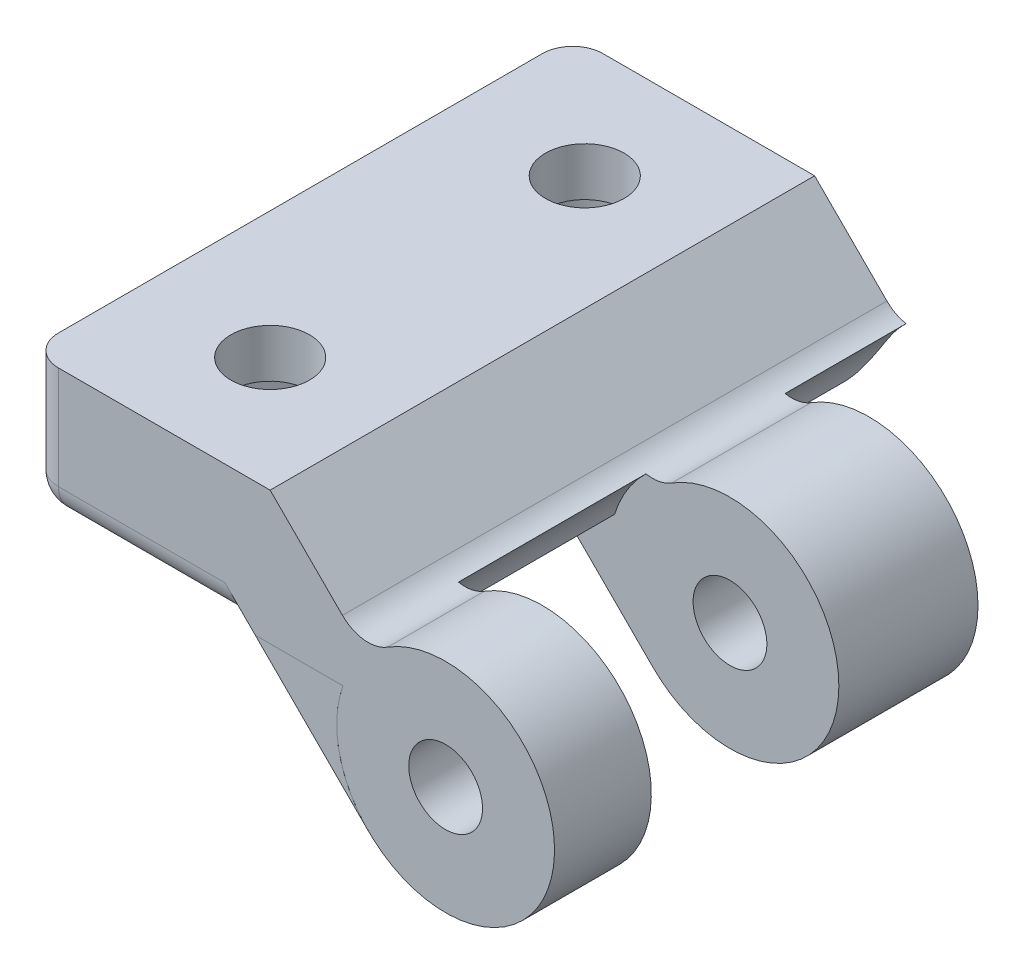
ISO-10303-21;
HEADER;
FILE_DESCRIPTION(('STEP AP214'),'2;1');
FILE_NAME('part.step','',(''),(''),'','','');
FILE_SCHEMA(('AUTOMOTIVE_DESIGN { 1 0 10303 214 1 1 1 1 }'));
ENDSEC;
DATA;
#1=APPLICATION_CONTEXT('core data for automotive mechanical design processes');
#2=APPLICATION_PROTOCOL_DEFINITION('international standard','automotive_design',2000,#1);
#3=PRODUCT_CONTEXT('',#1,'mechanical');
#4=PRODUCT('Part','Part','',(#3));
#5=PRODUCT_RELATED_PRODUCT_CATEGORY('part','',(#4));
#6=PRODUCT_DEFINITION_FORMATION('','',#4);
#7=PRODUCT_DEFINITION_CONTEXT('part definition',#1,'design');
#8=PRODUCT_DEFINITION('design','',#6,#7);
#9=PRODUCT_DEFINITION_SHAPE('','',#8);
#10=(LENGTH_UNIT() NAMED_UNIT(*) SI_UNIT(.MILLI.,.METRE.));
#11=(NAMED_UNIT(*) PLANE_ANGLE_UNIT() SI_UNIT($,.RADIAN.));
#12=(NAMED_UNIT(*) SI_UNIT($,.STERADIAN.) SOLID_ANGLE_UNIT());
#13=UNCERTAINTY_MEASURE_WITH_UNIT(LENGTH_MEASURE(1.E-05),#10,'distance_accuracy_value','');
#14=(GEOMETRIC_REPRESENTATION_CONTEXT(3) GLOBAL_UNCERTAINTY_ASSIGNED_CONTEXT((#13)) GLOBAL_UNIT_ASSIGNED_CONTEXT((#10,
#11,#12)) REPRESENTATION_CONTEXT('',''));
#15=CARTESIAN_POINT('',(0.,0.,0.));
#16=DIRECTION('',(0.,0.,1.));
#17=DIRECTION('',(1.,0.,0.));
#18=AXIS2_PLACEMENT_3D('',#15,#16,#17);
#19=CARTESIAN_POINT('',(-1.25,-1.99999999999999,0.));
#20=DIRECTION('',(0.,1.,0.));
#21=DIRECTION('',(0.,0.,1.));
#22=AXIS2_PLACEMENT_3D('',#19,#20,#21);
#23=PLANE('',#22);
#24=CARTESIAN_POINT('',(0.,-1.99999999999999,0.));
#25=DIRECTION('',(0.,-1.,0.));
#26=DIRECTION('',(0.,0.,-1.));
#27=AXIS2_PLACEMENT_3D('',#24,#25,#26);
#28=CIRCLE('',#27,2.5);
#29=CARTESIAN_POINT('',(0.,-1.99999999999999,-2.5));
#30=VERTEX_POINT('',#29);
#31=EDGE_CURVE('P0_E356',#30,#30,#28,.T.);
#32=ORIENTED_EDGE('',*,*,#31,.T.);
#33=EDGE_LOOP('',(#32));
#34=FACE_BOUND('',#33,.T.);
#35=ADVANCED_FACE('P0_F16',(#34),#23,.F.);
#36=CARTESIAN_POINT('',(0.,-5.5,0.));
#37=DIRECTION('',(0.,-1.,0.));
#38=DIRECTION('',(0.,0.,-1.));
#39=AXIS2_PLACEMENT_3D('',#36,#37,#38);
#40=CYLINDRICAL_SURFACE('',#39,2.5);
#41=ORIENTED_EDGE('',*,*,#31,.F.);
#42=EDGE_LOOP('',(#41));
#43=FACE_BOUND('',#42,.T.);
#44=CARTESIAN_POINT('',(0.,-8.99999999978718,0.));
#45=DIRECTION('',(0.,-1.,0.));
#46=DIRECTION('',(-1.,0.,0.));
#47=AXIS2_PLACEMENT_3D('',#44,#45,#46);
#48=CIRCLE('',#47,2.50000000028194);
#49=CARTESIAN_POINT('',(-2.50000000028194,-8.99999999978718,0.));
#50=VERTEX_POINT('',#49);
#51=EDGE_CURVE('P0_E351',#50,#50,#48,.T.);
#52=ORIENTED_EDGE('',*,*,#51,.T.);
#53=EDGE_LOOP('',(#52));
#54=FACE_BOUND('',#53,.T.);
#55=ADVANCED_FACE('P0_F815',(#43,#54),#40,.F.);
#56=CARTESIAN_POINT('',(0.,-10.0000000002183,0.));
#57=DIRECTION('',(0.,-1.,0.));
#58=DIRECTION('',(0.,0.,-1.));
#59=AXIS2_PLACEMENT_3D('',#56,#57,#58);
#60=CONICAL_SURFACE('',#59,3.07735026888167,0.523598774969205);
#61=ORIENTED_EDGE('',*,*,#51,.F.);
#62=EDGE_LOOP('',(#61));
#63=FACE_BOUND('',#62,.T.);
#64=CARTESIAN_POINT('',(0.,-10.0000000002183,0.));
#65=DIRECTION('',(0.,-1.,0.));
#66=DIRECTION('',(0.,0.,-1.));
#67=AXIS2_PLACEMENT_3D('',#64,#65,#66);
#68=CIRCLE('',#67,3.07735026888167);
#69=CARTESIAN_POINT('',(0.,-10.0000000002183,-3.07735026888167));
#70=VERTEX_POINT('',#69);
#71=EDGE_CURVE('P0_E355',#70,#70,#68,.T.);
#72=ORIENTED_EDGE('',*,*,#71,.T.);
#73=EDGE_LOOP('',(#72));
#74=FACE_BOUND('',#73,.T.);
#75=ADVANCED_FACE('P0_F812',(#63,#74),#60,.F.);
#76=CARTESIAN_POINT('',(24.,-14.,54.1827632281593));
#77=DIRECTION('',(0.,0.,-1.));
#78=DIRECTION('',(-1.,0.,0.));
#79=AXIS2_PLACEMENT_3D('',#76,#77,#78);
#80=CYLINDRICAL_SURFACE('',#79,3.05);
#81=CARTESIAN_POINT('',(24.,-14.,-1.00000000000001));
#82=DIRECTION('',(0.,0.,-1.));
#83=DIRECTION('',(-1.,0.,0.));
#84=AXIS2_PLACEMENT_3D('',#81,#82,#83);
#85=CIRCLE('',#84,3.05);
#86=CARTESIAN_POINT('',(20.95,-14.,-1.00000000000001));
#87=VERTEX_POINT('',#86);
#88=EDGE_CURVE('P0_E761',#87,#87,#85,.T.);
#89=ORIENTED_EDGE('',*,*,#88,.F.);
#90=EDGE_LOOP('',(#89));
#91=FACE_BOUND('',#90,.T.);
#92=CARTESIAN_POINT('',(24.,-14.,-12.5));
#93=DIRECTION('',(0.,0.,-1.));
#94=DIRECTION('',(-1.,0.,0.));
#95=AXIS2_PLACEMENT_3D('',#92,#93,#94);
#96=CIRCLE('',#95,3.05);
#97=CARTESIAN_POINT('',(20.95,-14.,-12.5));
#98=VERTEX_POINT('',#97);
#99=EDGE_CURVE('P0_E281',#98,#98,#96,.T.);
#100=ORIENTED_EDGE('',*,*,#99,.T.);
#101=EDGE_LOOP('',(#100));
#102=FACE_BOUND('',#101,.T.);
#103=ADVANCED_FACE('P0_F809',(#91,#102),#80,.F.);
#104=CARTESIAN_POINT('',(0.,-10.,0.));
#105=DIRECTION('',(0.,1.,0.));
#106=DIRECTION('',(0.,0.,1.));
#107=AXIS2_PLACEMENT_3D('',#104,#105,#106);
#108=PLANE('',#107);
#109=CARTESIAN_POINT('',(0.,-10.,-13.));
#110=DIRECTION('',(0.,1.,0.));
#111=DIRECTION('',(0.,0.,1.));
#112=AXIS2_PLACEMENT_3D('',#109,#110,#111);
#113=CIRCLE('',#112,5.5);
#114=CARTESIAN_POINT('',(5.5,-10.,-13.));
#115=VERTEX_POINT('',#114);
#116=CARTESIAN_POINT('',(-5.5,-10.,-13.));
#117=VERTEX_POINT('',#116);
#118=EDGE_CURVE('P0_E513',#115,#117,#113,.T.);
#119=ORIENTED_EDGE('',*,*,#118,.T.);
#120=DIRECTION('',(0.,0.,1.));
#121=VECTOR('',#120,1.);
#122=CARTESIAN_POINT('',(-5.5,-10.,-3.16227766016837));
#123=LINE('',#122,#121);
#124=CARTESIAN_POINT('',(-5.5,-10.,-3.16227766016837));
#125=VERTEX_POINT('',#124);
#126=EDGE_CURVE('P0_E323',#117,#125,#123,.T.);
#127=ORIENTED_EDGE('',*,*,#126,.T.);
#128=CARTESIAN_POINT('',(-4.5,-10.,-3.16227766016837));
#129=DIRECTION('',(0.,1.,0.));
#130=DIRECTION('',(0.,0.,1.));
#131=AXIS2_PLACEMENT_3D('',#128,#129,#130);
#132=CIRCLE('',#131,1.);
#133=CARTESIAN_POINT('',(-3.68181818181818,-10.,-2.58731808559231));
#134=VERTEX_POINT('',#133);
#135=EDGE_CURVE('P0_E509',#125,#134,#132,.T.);
#136=ORIENTED_EDGE('',*,*,#135,.T.);
#137=CARTESIAN_POINT('',(0.,-10.,0.));
#138=DIRECTION('',(0.,1.,0.));
#139=DIRECTION('',(0.,0.,1.));
#140=AXIS2_PLACEMENT_3D('',#137,#138,#139);
#141=CIRCLE('',#140,4.5);
#142=CARTESIAN_POINT('',(3.68181818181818,-10.,-2.58731808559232));
#143=VERTEX_POINT('',#142);
#144=EDGE_CURVE('P0_E505',#143,#134,#141,.T.);
#145=ORIENTED_EDGE('',*,*,#144,.F.);
#146=CARTESIAN_POINT('',(4.5,-10.,-3.16227766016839));
#147=DIRECTION('',(0.,1.,0.));
#148=DIRECTION('',(0.,0.,1.));
#149=AXIS2_PLACEMENT_3D('',#146,#147,#148);
#150=CIRCLE('',#149,1.);
#151=CARTESIAN_POINT('',(5.5,-10.,-3.16227766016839));
#152=VERTEX_POINT('',#151);
#153=EDGE_CURVE('P0_E495',#143,#152,#150,.T.);
#154=ORIENTED_EDGE('',*,*,#153,.T.);
#155=DIRECTION('',(0.,0.,-1.));
#156=VECTOR('',#155,1.);
#157=CARTESIAN_POINT('',(5.5,-10.,-13.));
#158=LINE('',#157,#156);
#159=EDGE_CURVE('P0_E318',#152,#115,#158,.T.);
#160=ORIENTED_EDGE('',*,*,#159,.T.);
#161=EDGE_LOOP('',(#119,#127,#136,#145,#154,#160));
#162=FACE_BOUND('',#161,.T.);
#163=CARTESIAN_POINT('',(0.,-10.,13.));
#164=DIRECTION('',(0.,1.,0.));
#165=DIRECTION('',(0.,0.,1.));
#166=AXIS2_PLACEMENT_3D('',#163,#164,#165);
#167=CIRCLE('',#166,5.5);
#168=CARTESIAN_POINT('',(-5.5,-10.,13.));
#169=VERTEX_POINT('',#168);
#170=CARTESIAN_POINT('',(5.50000000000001,-10.,13.));
#171=VERTEX_POINT('',#170);
#172=EDGE_CURVE('P0_E535',#169,#171,#167,.T.);
#173=ORIENTED_EDGE('',*,*,#172,.T.);
#174=DIRECTION('',(0.,0.,-1.));
#175=VECTOR('',#174,1.);
#176=CARTESIAN_POINT('',(5.50000000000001,-10.,3.16227766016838));
#177=LINE('',#176,#175);
#178=CARTESIAN_POINT('',(5.50000000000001,-10.,3.16227766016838));
#179=VERTEX_POINT('',#178);
#180=EDGE_CURVE('P0_E333',#171,#179,#177,.T.);
#181=ORIENTED_EDGE('',*,*,#180,.T.);
#182=CARTESIAN_POINT('',(4.5,-10.,3.16227766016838));
#183=DIRECTION('',(0.,1.,0.));
#184=DIRECTION('',(0.,0.,1.));
#185=AXIS2_PLACEMENT_3D('',#182,#183,#184);
#186=CIRCLE('',#185,1.);
#187=CARTESIAN_POINT('',(3.68181818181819,-10.,2.58731808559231));
#188=VERTEX_POINT('',#187);
#189=EDGE_CURVE('P0_E532',#179,#188,#186,.T.);
#190=ORIENTED_EDGE('',*,*,#189,.T.);
#191=CARTESIAN_POINT('',(0.,-10.,0.));
#192=DIRECTION('',(0.,1.,0.));
#193=DIRECTION('',(0.,0.,1.));
#194=AXIS2_PLACEMENT_3D('',#191,#192,#193);
#195=CIRCLE('',#194,4.5);
#196=CARTESIAN_POINT('',(-3.68181818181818,-10.,2.58731808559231));
#197=VERTEX_POINT('',#196);
#198=EDGE_CURVE('P0_E528',#197,#188,#195,.T.);
#199=ORIENTED_EDGE('',*,*,#198,.F.);
#200=CARTESIAN_POINT('',(-4.5,-10.,3.16227766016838));
#201=DIRECTION('',(0.,1.,0.));
#202=DIRECTION('',(0.,0.,1.));
#203=AXIS2_PLACEMENT_3D('',#200,#201,#202);
#204=CIRCLE('',#203,1.);
#205=CARTESIAN_POINT('',(-5.5,-10.,3.16227766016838));
#206=VERTEX_POINT('',#205);
#207=EDGE_CURVE('P0_E517',#197,#206,#204,.T.);
#208=ORIENTED_EDGE('',*,*,#207,.T.);
#209=DIRECTION('',(0.,0.,1.));
#210=VECTOR('',#209,1.);
#211=CARTESIAN_POINT('',(-5.5,-10.,13.));
#212=LINE('',#211,#210);
#213=EDGE_CURVE('P0_E328',#206,#169,#212,.T.);
#214=ORIENTED_EDGE('',*,*,#213,.T.);
#215=EDGE_LOOP('',(#173,#181,#190,#199,#208,#214));
#216=FACE_BOUND('',#215,.T.);
#217=ORIENTED_EDGE('',*,*,#71,.F.);
#218=EDGE_LOOP('',(#217));
#219=FACE_BOUND('',#218,.T.);
#220=DIRECTION('',(0.,0.,1.));
#221=VECTOR('',#220,1.);
#222=CARTESIAN_POINT('',(-6.5,-10.,13.));
#223=LINE('',#222,#221);
#224=CARTESIAN_POINT('',(-6.5,-10.,13.));
#225=VERTEX_POINT('',#224);
#226=CARTESIAN_POINT('',(-6.5,-10.,-13.));
#227=VERTEX_POINT('',#226);
#228=EDGE_CURVE('P0_E282',#225,#227,#223,.F.);
#229=ORIENTED_EDGE('',*,*,#228,.T.);
#230=CARTESIAN_POINT('',(0.,-10.,-13.));
#231=DIRECTION('',(0.,1.,0.));
#232=DIRECTION('',(0.,0.,1.));
#233=AXIS2_PLACEMENT_3D('',#230,#231,#232);
#234=CIRCLE('',#233,6.5);
#235=CARTESIAN_POINT('',(6.50000000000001,-10.,-13.));
#236=VERTEX_POINT('',#235);
#237=EDGE_CURVE('P0_E550',#227,#236,#234,.F.);
#238=ORIENTED_EDGE('',*,*,#237,.T.);
#239=DIRECTION('',(0.,0.,-1.));
#240=VECTOR('',#239,1.);
#241=CARTESIAN_POINT('',(6.50000000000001,-10.,-13.));
#242=LINE('',#241,#240);
#243=CARTESIAN_POINT('',(6.50000000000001,-10.,13.));
#244=VERTEX_POINT('',#243);
#245=EDGE_CURVE('P0_E345',#236,#244,#242,.F.);
#246=ORIENTED_EDGE('',*,*,#245,.T.);
#247=CARTESIAN_POINT('',(0.,-10.,13.));
#248=DIRECTION('',(0.,1.,0.));
#249=DIRECTION('',(0.,0.,1.));
#250=AXIS2_PLACEMENT_3D('',#247,#248,#249);
#251=CIRCLE('',#250,6.5);
#252=EDGE_CURVE('P0_E555',#244,#225,#251,.F.);
#253=ORIENTED_EDGE('',*,*,#252,.T.);
#254=EDGE_LOOP('',(#229,#238,#246,#253));
#255=FACE_BOUND('',#254,.T.);
#256=ADVANCED_FACE('P0_F779',(#162,#216,#219,#255),#108,.F.);
#257=CARTESIAN_POINT('',(8.27207793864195,-10.9999999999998,-1.));
#258=DIRECTION('',(-0.707106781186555,-0.70710678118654,0.));
#259=DIRECTION('',(0.70710678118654,-0.707106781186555,0.));
#260=AXIS2_PLACEMENT_3D('',#257,#258,#259);
#261=PLANE('',#260);
#262=DIRECTION('',(0.70710678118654,-0.707106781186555,0.));
#263=VECTOR('',#262,1.);
#264=CARTESIAN_POINT('',(8.27207793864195,-10.9999999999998,-1.00000000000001));
#265=LINE('',#264,#263);
#266=CARTESIAN_POINT('',(8.27207793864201,-11.,-1.00000000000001));
#267=VERTEX_POINT('',#266);
#268=CARTESIAN_POINT('',(17.636038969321,-20.3639610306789,-1.));
#269=VERTEX_POINT('',#268);
#270=EDGE_CURVE('P0_E288',#267,#269,#265,.T.);
#271=ORIENTED_EDGE('',*,*,#270,.F.);
#272=DIRECTION('',(0.,0.,-1.));
#273=VECTOR('',#272,1.);
#274=CARTESIAN_POINT('',(8.27207793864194,-11.,-22.5));
#275=LINE('',#274,#273);
#276=CARTESIAN_POINT('',(8.272077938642,-11.,-12.5));
#277=VERTEX_POINT('',#276);
#278=EDGE_CURVE('P0_E285',#277,#267,#275,.F.);
#279=ORIENTED_EDGE('',*,*,#278,.F.);
#280=DIRECTION('',(0.70710678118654,-0.707106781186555,0.));
#281=VECTOR('',#280,1.);
#282=CARTESIAN_POINT('',(8.27207793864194,-10.9999999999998,-12.5));
#283=LINE('',#282,#281);
#284=CARTESIAN_POINT('',(17.636038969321,-20.3639610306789,-12.5));
#285=VERTEX_POINT('',#284);
#286=EDGE_CURVE('P0_E270',#277,#285,#283,.T.);
#287=ORIENTED_EDGE('',*,*,#286,.T.);
#288=DIRECTION('',(0.,0.,1.));
#289=VECTOR('',#288,1.);
#290=CARTESIAN_POINT('',(17.636038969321,-20.3639610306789,-6.75));
#291=LINE('',#290,#289);
#292=EDGE_CURVE('P0_E338',#269,#285,#291,.F.);
#293=ORIENTED_EDGE('',*,*,#292,.F.);
#294=EDGE_LOOP('',(#271,#279,#287,#293));
#295=FACE_BOUND('',#294,.T.);
#296=ADVANCED_FACE('P0_F286',(#295),#261,.T.);
#297=CARTESIAN_POINT('',(0.,-11.,13.));
#298=DIRECTION('',(0.,1.,0.));
#299=DIRECTION('',(0.,0.,1.));
#300=AXIS2_PLACEMENT_3D('',#297,#298,#299);
#301=CYLINDRICAL_SURFACE('',#300,6.5);
#302=DIRECTION('',(0.,1.,0.));
#303=VECTOR('',#302,1.);
#304=CARTESIAN_POINT('',(6.50000000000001,-11.,13.));
#305=LINE('',#304,#303);
#306=CARTESIAN_POINT('',(6.5,-11.,13.));
#307=VERTEX_POINT('',#306);
#308=EDGE_CURVE('P0_E350',#244,#307,#305,.F.);
#309=ORIENTED_EDGE('',*,*,#308,.T.);
#310=CARTESIAN_POINT('',(0.,-11.,13.));
#311=DIRECTION('',(0.,1.,0.));
#312=DIRECTION('',(0.,0.,1.));
#313=AXIS2_PLACEMENT_3D('',#310,#311,#312);
#314=CIRCLE('',#313,6.5);
#315=CARTESIAN_POINT('',(-6.5,-11.,13.));
#316=VERTEX_POINT('',#315);
#317=EDGE_CURVE('P0_E452',#316,#307,#314,.T.);
#318=ORIENTED_EDGE('',*,*,#317,.F.);
#319=DIRECTION('',(0.,1.,0.));
#320=VECTOR('',#319,1.);
#321=CARTESIAN_POINT('',(-6.5,-11.,13.));
#322=LINE('',#321,#320);
#323=EDGE_CURVE('P0_E344',#316,#225,#322,.T.);
#324=ORIENTED_EDGE('',*,*,#323,.T.);
#325=ORIENTED_EDGE('',*,*,#252,.F.);
#326=EDGE_LOOP('',(#309,#318,#324,#325));
#327=FACE_BOUND('',#326,.T.);
#328=ADVANCED_FACE('P0_F785',(#327),#301,.F.);
#329=CARTESIAN_POINT('',(6.50000000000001,-11.,-13.));
#330=DIRECTION('',(1.,0.,0.));
#331=DIRECTION('',(0.,0.,-1.));
#332=AXIS2_PLACEMENT_3D('',#329,#330,#331);
#333=PLANE('',#332);
#334=DIRECTION('',(0.,1.,0.));
#335=VECTOR('',#334,1.);
#336=CARTESIAN_POINT('',(6.50000000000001,-11.,-13.));
#337=LINE('',#336,#335);
#338=CARTESIAN_POINT('',(6.5,-11.,-13.));
#339=VERTEX_POINT('',#338);
#340=EDGE_CURVE('P0_E349',#236,#339,#337,.F.);
#341=ORIENTED_EDGE('',*,*,#340,.T.);
#342=DIRECTION('',(0.,0.,-1.));
#343=VECTOR('',#342,1.);
#344=CARTESIAN_POINT('',(6.5,-11.,-22.5));
#345=LINE('',#344,#343);
#346=EDGE_CURVE('P0_E451',#307,#339,#345,.T.);
#347=ORIENTED_EDGE('',*,*,#346,.F.);
#348=ORIENTED_EDGE('',*,*,#308,.F.);
#349=ORIENTED_EDGE('',*,*,#245,.F.);
#350=EDGE_LOOP('',(#341,#347,#348,#349));
#351=FACE_BOUND('',#350,.T.);
#352=ADVANCED_FACE('P0_F795',(#351),#333,.F.);
#353=CARTESIAN_POINT('',(0.,-11.,-13.));
#354=DIRECTION('',(0.,1.,0.));
#355=DIRECTION('',(0.,0.,1.));
#356=AXIS2_PLACEMENT_3D('',#353,#354,#355);
#357=CYLINDRICAL_SURFACE('',#356,6.5);
#358=DIRECTION('',(0.,1.,0.));
#359=VECTOR('',#358,1.);
#360=CARTESIAN_POINT('',(-6.5,-11.,-13.));
#361=LINE('',#360,#359);
#362=CARTESIAN_POINT('',(-6.5,-11.,-13.));
#363=VERTEX_POINT('',#362);
#364=EDGE_CURVE('P0_E547',#227,#363,#361,.F.);
#365=ORIENTED_EDGE('',*,*,#364,.T.);
#366=CARTESIAN_POINT('',(0.,-11.,-13.));
#367=DIRECTION('',(0.,1.,0.));
#368=DIRECTION('',(0.,0.,1.));
#369=AXIS2_PLACEMENT_3D('',#366,#367,#368);
#370=CIRCLE('',#369,6.5);
#371=EDGE_CURVE('P0_E446',#339,#363,#370,.T.);
#372=ORIENTED_EDGE('',*,*,#371,.F.);
#373=ORIENTED_EDGE('',*,*,#340,.F.);
#374=ORIENTED_EDGE('',*,*,#237,.F.);
#375=EDGE_LOOP('',(#365,#372,#373,#374));
#376=FACE_BOUND('',#375,.T.);
#377=ADVANCED_FACE('P0_F791',(#376),#357,.F.);
#378=CARTESIAN_POINT('',(-6.5,-11.,13.));
#379=DIRECTION('',(-1.,0.,0.));
#380=DIRECTION('',(0.,0.,1.));
#381=AXIS2_PLACEMENT_3D('',#378,#379,#380);
#382=PLANE('',#381);
#383=ORIENTED_EDGE('',*,*,#323,.F.);
#384=DIRECTION('',(0.,0.,-1.));
#385=VECTOR('',#384,1.);
#386=CARTESIAN_POINT('',(-6.5,-11.,-22.5));
#387=LINE('',#386,#385);
#388=EDGE_CURVE('P0_E450',#363,#316,#387,.F.);
#389=ORIENTED_EDGE('',*,*,#388,.F.);
#390=ORIENTED_EDGE('',*,*,#364,.F.);
#391=ORIENTED_EDGE('',*,*,#228,.F.);
#392=EDGE_LOOP('',(#383,#389,#390,#391));
#393=FACE_BOUND('',#392,.T.);
#394=ADVANCED_FACE('P0_F788',(#393),#382,.F.);
#395=CARTESIAN_POINT('',(15.,-14.,-12.5));
#396=DIRECTION('',(0.,0.,1.));
#397=DIRECTION('',(1.,0.,0.));
#398=AXIS2_PLACEMENT_3D('',#395,#396,#397);
#399=PLANE('',#398);
#400=ORIENTED_EDGE('',*,*,#99,.F.);
#401=EDGE_LOOP('',(#400));
#402=FACE_BOUND('',#401,.T.);
#403=CARTESIAN_POINT('',(24.,-14.,-12.5));
#404=DIRECTION('',(0.,0.,1.));
#405=DIRECTION('',(0.,-1.,0.));
#406=AXIS2_PLACEMENT_3D('',#403,#404,#405);
#407=CIRCLE('',#406,9.);
#408=CARTESIAN_POINT('',(19.1946114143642,-6.39025358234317,-12.5));
#409=VERTEX_POINT('',#408);
#410=EDGE_CURVE('P0_E277',#285,#409,#407,.T.);
#411=ORIENTED_EDGE('',*,*,#410,.F.);
#412=ORIENTED_EDGE('',*,*,#286,.F.);
#413=DIRECTION('',(1.,0.,0.));
#414=VECTOR('',#413,1.);
#415=CARTESIAN_POINT('',(23.5,-11.,-12.5));
#416=LINE('',#415,#414);
#417=CARTESIAN_POINT('',(14.4606079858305,-11.,-12.5));
#418=VERTEX_POINT('',#417);
#419=EDGE_CURVE('P0_E274',#418,#277,#416,.F.);
#420=ORIENTED_EDGE('',*,*,#419,.F.);
#421=CARTESIAN_POINT('',(24.,-14.,-12.5));
#422=DIRECTION('',(0.,0.,1.));
#423=DIRECTION('',(1.,0.,0.));
#424=AXIS2_PLACEMENT_3D('',#421,#422,#423);
#425=CIRCLE('',#424,10.);
#426=CARTESIAN_POINT('',(17.0550023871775,-6.80507066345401,-12.5));
#427=VERTEX_POINT('',#426);
#428=EDGE_CURVE('P0_E464',#418,#427,#425,.F.);
#429=ORIENTED_EDGE('',*,*,#428,.T.);
#430=CARTESIAN_POINT('',(17.5928152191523,-3.85367144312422,-12.5));
#431=DIRECTION('',(0.,0.,-1.));
#432=DIRECTION('',(-1.,0.,0.));
#433=AXIS2_PLACEMENT_3D('',#430,#431,#432);
#434=CIRCLE('',#433,3.);
#435=EDGE_CURVE('P0_E438',#427,#409,#434,.F.);
#436=ORIENTED_EDGE('',*,*,#435,.T.);
#437=EDGE_LOOP('',(#411,#412,#420,#429,#436));
#438=FACE_BOUND('',#437,.T.);
#439=ADVANCED_FACE('P0_F272',(#402,#438),#399,.F.);
#440=CARTESIAN_POINT('',(24.,-14.,-6.75));
#441=DIRECTION('',(0.,0.,1.));
#442=DIRECTION('',(0.,-1.,0.));
#443=AXIS2_PLACEMENT_3D('',#440,#441,#442);
#444=CYLINDRICAL_SURFACE('',#443,9.);
#445=DIRECTION('',(0.,0.,-1.));
#446=VECTOR('',#445,1.);
#447=CARTESIAN_POINT('',(19.1946114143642,-6.39025358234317,22.5));
#448=LINE('',#447,#446);
#449=CARTESIAN_POINT('',(19.1946114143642,-6.39025358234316,-1.));
#450=VERTEX_POINT('',#449);
#451=EDGE_CURVE('P0_E437',#409,#450,#448,.F.);
#452=ORIENTED_EDGE('',*,*,#451,.T.);
#453=CARTESIAN_POINT('',(24.,-14.,-1.));
#454=DIRECTION('',(0.,0.,1.));
#455=DIRECTION('',(0.,-1.,0.));
#456=AXIS2_PLACEMENT_3D('',#453,#454,#455);
#457=CIRCLE('',#456,9.);
#458=EDGE_CURVE('P0_E540',#269,#450,#457,.T.);
#459=ORIENTED_EDGE('',*,*,#458,.F.);
#460=ORIENTED_EDGE('',*,*,#292,.T.);
#461=ORIENTED_EDGE('',*,*,#410,.T.);
#462=EDGE_LOOP('',(#452,#459,#460,#461));
#463=FACE_BOUND('',#462,.T.);
#464=ADVANCED_FACE('P0_F878',(#463),#444,.T.);
#465=CARTESIAN_POINT('',(24.,-14.,-1.00000000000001));
#466=DIRECTION('',(0.,0.,1.));
#467=DIRECTION('',(1.,0.,0.));
#468=AXIS2_PLACEMENT_3D('',#465,#466,#467);
#469=PLANE('',#468);
#470=ORIENTED_EDGE('',*,*,#88,.T.);
#471=EDGE_LOOP('',(#470));
#472=FACE_BOUND('',#471,.T.);
#473=ORIENTED_EDGE('',*,*,#270,.T.);
#474=ORIENTED_EDGE('',*,*,#458,.T.);
#475=CARTESIAN_POINT('',(17.5928152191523,-3.85367144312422,-1.));
#476=DIRECTION('',(0.,0.,-1.));
#477=DIRECTION('',(-1.,0.,0.));
#478=AXIS2_PLACEMENT_3D('',#475,#476,#477);
#479=CIRCLE('',#478,3.);
#480=CARTESIAN_POINT('',(17.0550023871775,-6.80507066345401,-1.));
#481=VERTEX_POINT('',#480);
#482=EDGE_CURVE('P0_E434',#450,#481,#479,.T.);
#483=ORIENTED_EDGE('',*,*,#482,.T.);
#484=CARTESIAN_POINT('',(24.,-14.,-1.));
#485=DIRECTION('',(0.,0.,1.));
#486=DIRECTION('',(1.,0.,0.));
#487=AXIS2_PLACEMENT_3D('',#484,#485,#486);
#488=CIRCLE('',#487,10.);
#489=CARTESIAN_POINT('',(14.4606079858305,-11.,-1.));
#490=VERTEX_POINT('',#489);
#491=EDGE_CURVE('P0_E768',#481,#490,#488,.T.);
#492=ORIENTED_EDGE('',*,*,#491,.T.);
#493=DIRECTION('',(1.,0.,0.));
#494=VECTOR('',#493,1.);
#495=CARTESIAN_POINT('',(23.5,-11.,-1.));
#496=LINE('',#495,#494);
#497=EDGE_CURVE('P0_E292',#267,#490,#496,.T.);
#498=ORIENTED_EDGE('',*,*,#497,.F.);
#499=EDGE_LOOP('',(#473,#474,#483,#492,#498));
#500=FACE_BOUND('',#499,.T.);
#501=ADVANCED_FACE('P0_F886',(#472,#500),#469,.T.);
#502=CARTESIAN_POINT('',(24.,-14.,-1.));
#503=DIRECTION('',(0.,0.,1.));
#504=DIRECTION('',(1.,0.,0.));
#505=AXIS2_PLACEMENT_3D('',#502,#503,#504);
#506=CYLINDRICAL_SURFACE('',#505,10.);
#507=CARTESIAN_POINT('',(24.,-14.,14.5));
#508=DIRECTION('',(0.,0.,1.));
#509=DIRECTION('',(1.,0.,0.));
#510=AXIS2_PLACEMENT_3D('',#507,#508,#509);
#511=CIRCLE('',#510,10.);
#512=CARTESIAN_POINT('',(17.0550023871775,-6.805070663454,14.5));
#513=VERTEX_POINT('',#512);
#514=CARTESIAN_POINT('',(14.4606079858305,-11.,14.5));
#515=VERTEX_POINT('',#514);
#516=EDGE_CURVE('P0_E1086',#513,#515,#511,.T.);
#517=ORIENTED_EDGE('',*,*,#516,.T.);
#518=DIRECTION('',(0.,0.,-1.));
#519=VECTOR('',#518,1.);
#520=CARTESIAN_POINT('',(14.4606079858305,-11.,-22.5));
#521=LINE('',#520,#519);
#522=EDGE_CURVE('P0_E309',#490,#515,#521,.F.);
#523=ORIENTED_EDGE('',*,*,#522,.F.);
#524=ORIENTED_EDGE('',*,*,#491,.F.);
#525=DIRECTION('',(0.,0.,-1.));
#526=VECTOR('',#525,1.);
#527=CARTESIAN_POINT('',(17.0550023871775,-6.805070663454,22.5));
#528=LINE('',#527,#526);
#529=EDGE_CURVE('P0_E433',#481,#513,#528,.F.);
#530=ORIENTED_EDGE('',*,*,#529,.T.);
#531=EDGE_LOOP('',(#517,#523,#524,#530));
#532=FACE_BOUND('',#531,.T.);
#533=ADVANCED_FACE('P0_F893',(#532),#506,.F.);
#534=CARTESIAN_POINT('',(15.,-14.,14.5));
#535=DIRECTION('',(0.,0.,1.));
#536=DIRECTION('',(1.,0.,0.));
#537=AXIS2_PLACEMENT_3D('',#534,#535,#536);
#538=PLANE('',#537);
#539=CARTESIAN_POINT('',(24.,-14.,14.5));
#540=DIRECTION('',(0.,0.,-1.));
#541=DIRECTION('',(-1.,0.,0.));
#542=AXIS2_PLACEMENT_3D('',#539,#540,#541);
#543=CIRCLE('',#542,3.05);
#544=CARTESIAN_POINT('',(20.95,-14.,14.5));
#545=VERTEX_POINT('',#544);
#546=EDGE_CURVE('P0_E426',#545,#545,#543,.F.);
#547=ORIENTED_EDGE('',*,*,#546,.T.);
#548=EDGE_LOOP('',(#547));
#549=FACE_BOUND('',#548,.T.);
#550=CARTESIAN_POINT('',(24.,-14.,14.5));
#551=DIRECTION('',(0.,0.,1.));
#552=DIRECTION('',(0.,-1.,0.));
#553=AXIS2_PLACEMENT_3D('',#550,#551,#552);
#554=CIRCLE('',#553,9.00000000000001);
#555=CARTESIAN_POINT('',(15.5147186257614,-11.,14.5));
#556=VERTEX_POINT('',#555);
#557=CARTESIAN_POINT('',(19.1946114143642,-6.39025358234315,14.5));
#558=VERTEX_POINT('',#557);
#559=EDGE_CURVE('P0_E564',#556,#558,#554,.T.);
#560=ORIENTED_EDGE('',*,*,#559,.F.);
#561=DIRECTION('',(1.,0.,0.));
#562=VECTOR('',#561,1.);
#563=CARTESIAN_POINT('',(23.5,-11.,14.5));
#564=LINE('',#563,#562);
#565=EDGE_CURVE('P0_E313',#515,#556,#564,.T.);
#566=ORIENTED_EDGE('',*,*,#565,.F.);
#567=ORIENTED_EDGE('',*,*,#516,.F.);
#568=CARTESIAN_POINT('',(17.5928152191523,-3.85367144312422,14.5));
#569=DIRECTION('',(0.,0.,-1.));
#570=DIRECTION('',(-1.,0.,0.));
#571=AXIS2_PLACEMENT_3D('',#568,#569,#570);
#572=CIRCLE('',#571,3.);
#573=EDGE_CURVE('P0_E431',#513,#558,#572,.F.);
#574=ORIENTED_EDGE('',*,*,#573,.T.);
#575=EDGE_LOOP('',(#560,#566,#567,#574));
#576=FACE_BOUND('',#575,.T.);
#577=ADVANCED_FACE('P0_F901',(#549,#576),#538,.F.);
#578=CARTESIAN_POINT('',(0.,-10.,13.));
#579=DIRECTION('',(0.,1.,0.));
#580=DIRECTION('',(0.,0.,1.));
#581=AXIS2_PLACEMENT_3D('',#578,#579,#580);
#582=CYLINDRICAL_SURFACE('',#581,5.5);
#583=DIRECTION('',(0.,1.,0.));
#584=VECTOR('',#583,1.);
#585=CARTESIAN_POINT('',(5.50000000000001,-10.,13.));
#586=LINE('',#585,#584);
#587=CARTESIAN_POINT('',(5.5,-4.,13.));
#588=VERTEX_POINT('',#587);
#589=EDGE_CURVE('P0_E337',#588,#171,#586,.F.);
#590=ORIENTED_EDGE('',*,*,#589,.T.);
#591=ORIENTED_EDGE('',*,*,#172,.F.);
#592=DIRECTION('',(0.,1.,0.));
#593=VECTOR('',#592,1.);
#594=CARTESIAN_POINT('',(-5.5,-10.,13.));
#595=LINE('',#594,#593);
#596=CARTESIAN_POINT('',(-5.5,-4.,13.));
#597=VERTEX_POINT('',#596);
#598=EDGE_CURVE('P0_E331',#169,#597,#595,.T.);
#599=ORIENTED_EDGE('',*,*,#598,.T.);
#600=CARTESIAN_POINT('',(0.,-4.,13.));
#601=DIRECTION('',(0.,1.,0.));
#602=DIRECTION('',(0.,0.,1.));
#603=AXIS2_PLACEMENT_3D('',#600,#601,#602);
#604=CIRCLE('',#603,5.5);
#605=EDGE_CURVE('P0_E423',#597,#588,#604,.T.);
#606=ORIENTED_EDGE('',*,*,#605,.T.);
#607=EDGE_LOOP('',(#590,#591,#599,#606));
#608=FACE_BOUND('',#607,.T.);
#609=ADVANCED_FACE('P0_F909',(#608),#582,.F.);
#610=CARTESIAN_POINT('',(5.50000000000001,-10.,3.16227766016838));
#611=DIRECTION('',(1.,0.,0.));
#612=DIRECTION('',(0.,0.,-1.));
#613=AXIS2_PLACEMENT_3D('',#610,#611,#612);
#614=PLANE('',#613);
#615=DIRECTION('',(0.,1.,0.));
#616=VECTOR('',#615,1.);
#617=CARTESIAN_POINT('',(5.50000000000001,-10.,3.16227766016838));
#618=LINE('',#617,#616);
#619=CARTESIAN_POINT('',(5.5,-4.,3.16227766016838));
#620=VERTEX_POINT('',#619);
#621=EDGE_CURVE('P0_E336',#620,#179,#618,.F.);
#622=ORIENTED_EDGE('',*,*,#621,.T.);
#623=ORIENTED_EDGE('',*,*,#180,.F.);
#624=ORIENTED_EDGE('',*,*,#589,.F.);
#625=DIRECTION('',(0.,0.,1.));
#626=VECTOR('',#625,1.);
#627=CARTESIAN_POINT('',(5.5,-4.,9.53474503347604));
#628=LINE('',#627,#626);
#629=EDGE_CURVE('P0_E422',#588,#620,#628,.F.);
#630=ORIENTED_EDGE('',*,*,#629,.T.);
#631=EDGE_LOOP('',(#622,#623,#624,#630));
#632=FACE_BOUND('',#631,.T.);
#633=ADVANCED_FACE('P0_F916',(#632),#614,.F.);
#634=CARTESIAN_POINT('',(4.5,-10.,3.16227766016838));
#635=DIRECTION('',(0.,1.,0.));
#636=DIRECTION('',(0.,0.,1.));
#637=AXIS2_PLACEMENT_3D('',#634,#635,#636);
#638=CYLINDRICAL_SURFACE('',#637,1.);
#639=DIRECTION('',(0.,1.,0.));
#640=VECTOR('',#639,1.);
#641=CARTESIAN_POINT('',(3.68181818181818,-10.,2.58731808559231));
#642=LINE('',#641,#640);
#643=CARTESIAN_POINT('',(3.68181818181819,-4.,2.58731808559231));
#644=VERTEX_POINT('',#643);
#645=EDGE_CURVE('P0_E524',#188,#644,#642,.T.);
#646=ORIENTED_EDGE('',*,*,#645,.F.);
#647=ORIENTED_EDGE('',*,*,#189,.F.);
#648=ORIENTED_EDGE('',*,*,#621,.F.);
#649=CARTESIAN_POINT('',(4.5,-4.,3.16227766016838));
#650=DIRECTION('',(0.,1.,0.));
#651=DIRECTION('',(0.,0.,1.));
#652=AXIS2_PLACEMENT_3D('',#649,#650,#651);
#653=CIRCLE('',#652,1.);
#654=EDGE_CURVE('P0_E419',#620,#644,#653,.T.);
#655=ORIENTED_EDGE('',*,*,#654,.T.);
#656=EDGE_LOOP('',(#646,#647,#648,#655));
#657=FACE_BOUND('',#656,.T.);
#658=ADVANCED_FACE('P0_F923',(#657),#638,.F.);
#659=CARTESIAN_POINT('',(0.,-10.,0.));
#660=DIRECTION('',(0.,1.,0.));
#661=DIRECTION('',(0.,0.,1.));
#662=AXIS2_PLACEMENT_3D('',#659,#660,#661);
#663=CYLINDRICAL_SURFACE('',#662,4.5);
#664=ORIENTED_EDGE('',*,*,#198,.T.);
#665=ORIENTED_EDGE('',*,*,#645,.T.);
#666=CARTESIAN_POINT('',(0.,-4.,0.));
#667=DIRECTION('',(0.,1.,0.));
#668=DIRECTION('',(0.,0.,1.));
#669=AXIS2_PLACEMENT_3D('',#666,#667,#668);
#670=CIRCLE('',#669,4.5);
#671=CARTESIAN_POINT('',(-3.68181818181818,-4.,2.58731808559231));
#672=VERTEX_POINT('',#671);
#673=EDGE_CURVE('P0_E416',#644,#672,#670,.F.);
#674=ORIENTED_EDGE('',*,*,#673,.T.);
#675=DIRECTION('',(0.,1.,0.));
#676=VECTOR('',#675,1.);
#677=CARTESIAN_POINT('',(-3.68181818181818,-10.,2.58731808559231));
#678=LINE('',#677,#676);
#679=EDGE_CURVE('P0_E520',#672,#197,#678,.F.);
#680=ORIENTED_EDGE('',*,*,#679,.T.);
#681=EDGE_LOOP('',(#664,#665,#674,#680));
#682=FACE_BOUND('',#681,.T.);
#683=ADVANCED_FACE('P0_F931',(#682),#663,.T.);
#684=CARTESIAN_POINT('',(-4.5,-10.,3.16227766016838));
#685=DIRECTION('',(0.,1.,0.));
#686=DIRECTION('',(0.,0.,1.));
#687=AXIS2_PLACEMENT_3D('',#684,#685,#686);
#688=CYLINDRICAL_SURFACE('',#687,1.);
#689=DIRECTION('',(0.,1.,0.));
#690=VECTOR('',#689,1.);
#691=CARTESIAN_POINT('',(-5.5,-10.,3.16227766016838));
#692=LINE('',#691,#690);
#693=CARTESIAN_POINT('',(-5.5,-4.,3.16227766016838));
#694=VERTEX_POINT('',#693);
#695=EDGE_CURVE('P0_E332',#694,#206,#692,.F.);
#696=ORIENTED_EDGE('',*,*,#695,.T.);
#697=ORIENTED_EDGE('',*,*,#207,.F.);
#698=ORIENTED_EDGE('',*,*,#679,.F.);
#699=CARTESIAN_POINT('',(-4.5,-4.,3.16227766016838));
#700=DIRECTION('',(0.,1.,0.));
#701=DIRECTION('',(0.,0.,1.));
#702=AXIS2_PLACEMENT_3D('',#699,#700,#701);
#703=CIRCLE('',#702,1.);
#704=EDGE_CURVE('P0_E413',#672,#694,#703,.T.);
#705=ORIENTED_EDGE('',*,*,#704,.T.);
#706=EDGE_LOOP('',(#696,#697,#698,#705));
#707=FACE_BOUND('',#706,.T.);
#708=ADVANCED_FACE('P0_F938',(#707),#688,.F.);
#709=CARTESIAN_POINT('',(-5.5,-10.,13.));
#710=DIRECTION('',(-1.,0.,0.));
#711=DIRECTION('',(0.,0.,1.));
#712=AXIS2_PLACEMENT_3D('',#709,#710,#711);
#713=PLANE('',#712);
#714=ORIENTED_EDGE('',*,*,#598,.F.);
#715=ORIENTED_EDGE('',*,*,#213,.F.);
#716=ORIENTED_EDGE('',*,*,#695,.F.);
#717=DIRECTION('',(0.,0.,1.));
#718=VECTOR('',#717,1.);
#719=CARTESIAN_POINT('',(-5.5,-4.,9.53474503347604));
#720=LINE('',#719,#718);
#721=EDGE_CURVE('P0_E412',#694,#597,#720,.T.);
#722=ORIENTED_EDGE('',*,*,#721,.T.);
#723=EDGE_LOOP('',(#714,#715,#716,#722));
#724=FACE_BOUND('',#723,.T.);
#725=ADVANCED_FACE('P0_F945',(#724),#713,.F.);
#726=CARTESIAN_POINT('',(0.,-10.,-13.));
#727=DIRECTION('',(0.,1.,0.));
#728=DIRECTION('',(0.,0.,1.));
#729=AXIS2_PLACEMENT_3D('',#726,#727,#728);
#730=CYLINDRICAL_SURFACE('',#729,5.5);
#731=DIRECTION('',(0.,1.,0.));
#732=VECTOR('',#731,1.);
#733=CARTESIAN_POINT('',(-5.5,-10.,-13.));
#734=LINE('',#733,#732);
#735=CARTESIAN_POINT('',(-5.5,-4.,-13.));
#736=VERTEX_POINT('',#735);
#737=EDGE_CURVE('P0_E327',#736,#117,#734,.F.);
#738=ORIENTED_EDGE('',*,*,#737,.T.);
#739=ORIENTED_EDGE('',*,*,#118,.F.);
#740=DIRECTION('',(0.,1.,0.));
#741=VECTOR('',#740,1.);
#742=CARTESIAN_POINT('',(5.5,-10.,-13.));
#743=LINE('',#742,#741);
#744=CARTESIAN_POINT('',(5.5,-4.,-13.));
#745=VERTEX_POINT('',#744);
#746=EDGE_CURVE('P0_E321',#115,#745,#743,.T.);
#747=ORIENTED_EDGE('',*,*,#746,.T.);
#748=CARTESIAN_POINT('',(0.,-4.,-13.));
#749=DIRECTION('',(0.,1.,0.));
#750=DIRECTION('',(0.,0.,1.));
#751=AXIS2_PLACEMENT_3D('',#748,#749,#750);
#752=CIRCLE('',#751,5.5);
#753=EDGE_CURVE('P0_E409',#745,#736,#752,.T.);
#754=ORIENTED_EDGE('',*,*,#753,.T.);
#755=EDGE_LOOP('',(#738,#739,#747,#754));
#756=FACE_BOUND('',#755,.T.);
#757=ADVANCED_FACE('P0_F952',(#756),#730,.F.);
#758=CARTESIAN_POINT('',(-5.5,-10.,-3.16227766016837));
#759=DIRECTION('',(-1.,0.,0.));
#760=DIRECTION('',(0.,0.,1.));
#761=AXIS2_PLACEMENT_3D('',#758,#759,#760);
#762=PLANE('',#761);
#763=DIRECTION('',(0.,1.,0.));
#764=VECTOR('',#763,1.);
#765=CARTESIAN_POINT('',(-5.5,-10.,-3.16227766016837));
#766=LINE('',#765,#764);
#767=CARTESIAN_POINT('',(-5.5,-4.,-3.16227766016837));
#768=VERTEX_POINT('',#767);
#769=EDGE_CURVE('P0_E326',#768,#125,#766,.F.);
#770=ORIENTED_EDGE('',*,*,#769,.T.);
#771=ORIENTED_EDGE('',*,*,#126,.F.);
#772=ORIENTED_EDGE('',*,*,#737,.F.);
#773=DIRECTION('',(0.,0.,1.));
#774=VECTOR('',#773,1.);
#775=CARTESIAN_POINT('',(-5.5,-4.,-9.53474503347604));
#776=LINE('',#775,#774);
#777=EDGE_CURVE('P0_E408',#736,#768,#776,.T.);
#778=ORIENTED_EDGE('',*,*,#777,.T.);
#779=EDGE_LOOP('',(#770,#771,#772,#778));
#780=FACE_BOUND('',#779,.T.);
#781=ADVANCED_FACE('P0_F959',(#780),#762,.F.);
#782=CARTESIAN_POINT('',(-4.5,-10.,-3.16227766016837));
#783=DIRECTION('',(0.,1.,0.));
#784=DIRECTION('',(0.,0.,1.));
#785=AXIS2_PLACEMENT_3D('',#782,#783,#784);
#786=CYLINDRICAL_SURFACE('',#785,1.);
#787=DIRECTION('',(0.,1.,0.));
#788=VECTOR('',#787,1.);
#789=CARTESIAN_POINT('',(-3.68181818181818,-10.,-2.58731808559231));
#790=LINE('',#789,#788);
#791=CARTESIAN_POINT('',(-3.68181818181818,-4.,-2.58731808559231));
#792=VERTEX_POINT('',#791);
#793=EDGE_CURVE('P0_E501',#134,#792,#790,.T.);
#794=ORIENTED_EDGE('',*,*,#793,.F.);
#795=ORIENTED_EDGE('',*,*,#135,.F.);
#796=ORIENTED_EDGE('',*,*,#769,.F.);
#797=CARTESIAN_POINT('',(-4.5,-4.,-3.16227766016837));
#798=DIRECTION('',(0.,1.,0.));
#799=DIRECTION('',(0.,0.,1.));
#800=AXIS2_PLACEMENT_3D('',#797,#798,#799);
#801=CIRCLE('',#800,1.);
#802=EDGE_CURVE('P0_E406',#768,#792,#801,.T.);
#803=ORIENTED_EDGE('',*,*,#802,.T.);
#804=EDGE_LOOP('',(#794,#795,#796,#803));
#805=FACE_BOUND('',#804,.T.);
#806=ADVANCED_FACE('P0_F966',(#805),#786,.F.);
#807=CARTESIAN_POINT('',(0.,-10.,0.));
#808=DIRECTION('',(0.,1.,0.));
#809=DIRECTION('',(0.,0.,1.));
#810=AXIS2_PLACEMENT_3D('',#807,#808,#809);
#811=CYLINDRICAL_SURFACE('',#810,4.5);
#812=ORIENTED_EDGE('',*,*,#144,.T.);
#813=ORIENTED_EDGE('',*,*,#793,.T.);
#814=CARTESIAN_POINT('',(0.,-4.,0.));
#815=DIRECTION('',(0.,1.,0.));
#816=DIRECTION('',(0.,0.,1.));
#817=AXIS2_PLACEMENT_3D('',#814,#815,#816);
#818=CIRCLE('',#817,4.5);
#819=CARTESIAN_POINT('',(3.68181818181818,-4.,-2.58731808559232));
#820=VERTEX_POINT('',#819);
#821=EDGE_CURVE('P0_E403',#792,#820,#818,.F.);
#822=ORIENTED_EDGE('',*,*,#821,.T.);
#823=DIRECTION('',(0.,1.,0.));
#824=VECTOR('',#823,1.);
#825=CARTESIAN_POINT('',(3.68181818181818,-10.,-2.58731808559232));
#826=LINE('',#825,#824);
#827=EDGE_CURVE('P0_E497',#820,#143,#826,.F.);
#828=ORIENTED_EDGE('',*,*,#827,.T.);
#829=EDGE_LOOP('',(#812,#813,#822,#828));
#830=FACE_BOUND('',#829,.T.);
#831=ADVANCED_FACE('P0_F974',(#830),#811,.T.);
#832=CARTESIAN_POINT('',(4.5,-10.,-3.16227766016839));
#833=DIRECTION('',(0.,1.,0.));
#834=DIRECTION('',(0.,0.,1.));
#835=AXIS2_PLACEMENT_3D('',#832,#833,#834);
#836=CYLINDRICAL_SURFACE('',#835,1.);
#837=DIRECTION('',(0.,1.,0.));
#838=VECTOR('',#837,1.);
#839=CARTESIAN_POINT('',(5.5,-10.,-3.16227766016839));
#840=LINE('',#839,#838);
#841=CARTESIAN_POINT('',(5.5,-4.,-3.16227766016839));
#842=VERTEX_POINT('',#841);
#843=EDGE_CURVE('P0_E322',#842,#152,#840,.F.);
#844=ORIENTED_EDGE('',*,*,#843,.T.);
#845=ORIENTED_EDGE('',*,*,#153,.F.);
#846=ORIENTED_EDGE('',*,*,#827,.F.);
#847=CARTESIAN_POINT('',(4.5,-4.,-3.16227766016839));
#848=DIRECTION('',(0.,1.,0.));
#849=DIRECTION('',(0.,0.,1.));
#850=AXIS2_PLACEMENT_3D('',#847,#848,#849);
#851=CIRCLE('',#850,1.);
#852=EDGE_CURVE('P0_E399',#820,#842,#851,.T.);
#853=ORIENTED_EDGE('',*,*,#852,.T.);
#854=EDGE_LOOP('',(#844,#845,#846,#853));
#855=FACE_BOUND('',#854,.T.);
#856=ADVANCED_FACE('P0_F981',(#855),#836,.F.);
#857=CARTESIAN_POINT('',(5.5,-10.,-13.));
#858=DIRECTION('',(1.,0.,0.));
#859=DIRECTION('',(0.,0.,-1.));
#860=AXIS2_PLACEMENT_3D('',#857,#858,#859);
#861=PLANE('',#860);
#862=ORIENTED_EDGE('',*,*,#746,.F.);
#863=ORIENTED_EDGE('',*,*,#159,.F.);
#864=ORIENTED_EDGE('',*,*,#843,.F.);
#865=DIRECTION('',(0.,0.,1.));
#866=VECTOR('',#865,1.);
#867=CARTESIAN_POINT('',(5.5,-4.,-9.53474503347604));
#868=LINE('',#867,#866);
#869=EDGE_CURVE('P0_E402',#842,#745,#868,.F.);
#870=ORIENTED_EDGE('',*,*,#869,.T.);
#871=EDGE_LOOP('',(#862,#863,#864,#870));
#872=FACE_BOUND('',#871,.T.);
#873=ADVANCED_FACE('P0_F988',(#872),#861,.F.);
#874=CARTESIAN_POINT('',(24.,-14.,-22.5));
#875=DIRECTION('',(0.,0.,1.));
#876=DIRECTION('',(1.,0.,0.));
#877=AXIS2_PLACEMENT_3D('',#874,#875,#876);
#878=CYLINDRICAL_SURFACE('',#877,10.);
#879=ORIENTED_EDGE('',*,*,#428,.F.);
#880=DIRECTION('',(0.,0.,-1.));
#881=VECTOR('',#880,1.);
#882=CARTESIAN_POINT('',(14.4606079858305,-11.,-22.5));
#883=LINE('',#882,#881);
#884=CARTESIAN_POINT('',(14.4606079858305,-11.,-20.));
#885=VERTEX_POINT('',#884);
#886=EDGE_CURVE('P0_E298',#885,#418,#883,.F.);
#887=ORIENTED_EDGE('',*,*,#886,.F.);
#888=CARTESIAN_POINT('',(15.648353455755,-8.5,-22.5));
#889=CARTESIAN_POINT('',(15.6018914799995,-8.57053462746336,-22.500003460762));
#890=CARTESIAN_POINT('',(15.5563251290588,-8.64168836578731,-22.4970143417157));
#891=CARTESIAN_POINT('',(15.467203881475,-8.78478655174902,-22.4847643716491));
#892=CARTESIAN_POINT('',(15.4236506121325,-8.85673158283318,-22.475498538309));
#893=CARTESIAN_POINT('',(15.3386086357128,-9.00126200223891,-22.4503361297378));
#894=CARTESIAN_POINT('',(15.2971331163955,-9.07384870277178,-22.4344020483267));
#895=CARTESIAN_POINT('',(15.2167704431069,-9.21860622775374,-22.3956663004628));
#896=CARTESIAN_POINT('',(15.1778826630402,-9.29077714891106,-22.3728663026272));
#897=CARTESIAN_POINT('',(15.1027036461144,-9.43439785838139,-22.3200828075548));
#898=CARTESIAN_POINT('',(15.0664276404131,-9.50584161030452,-22.2900610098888));
#899=CARTESIAN_POINT('',(14.9969036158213,-9.64679073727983,-22.222828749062));
#900=CARTESIAN_POINT('',(14.9636552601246,-9.71629632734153,-22.185619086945));
#901=CARTESIAN_POINT('',(14.9004169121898,-9.85232644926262,-22.1041567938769));
#902=CARTESIAN_POINT('',(14.8704181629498,-9.91885869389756,-22.0599239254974));
#903=CARTESIAN_POINT('',(14.8136819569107,-10.048220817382,-21.9645560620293));
#904=CARTESIAN_POINT('',(14.7869439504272,-10.1110513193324,-21.9134222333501));
#905=CARTESIAN_POINT('',(14.7178201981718,-10.2778609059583,-21.7633962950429));
#906=CARTESIAN_POINT('',(14.6788317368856,-10.3771573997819,-21.6575585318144));
#907=CARTESIAN_POINT('',(14.6108826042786,-10.5570651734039,-21.4281979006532));
#908=CARTESIAN_POINT('',(14.5819260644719,-10.6376687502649,-21.304667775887));
#909=CARTESIAN_POINT('',(14.5354107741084,-10.7710443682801,-21.0540131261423));
#910=CARTESIAN_POINT('',(14.5171439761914,-10.8254862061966,-20.9279046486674));
#911=CARTESIAN_POINT('',(14.4882723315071,-10.9130610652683,-20.667767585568));
#912=CARTESIAN_POINT('',(14.4776570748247,-10.9462230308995,-20.533750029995));
#913=CARTESIAN_POINT('',(14.46731395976,-10.978741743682,-20.3321126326));
#914=CARTESIAN_POINT('',(14.4647945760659,-10.9867124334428,-20.2659107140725));
#915=CARTESIAN_POINT('',(14.46144488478,-10.9973371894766,-20.1331499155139));
#916=CARTESIAN_POINT('',(14.4606117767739,-11.000000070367,-20.0665918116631));
#917=CARTESIAN_POINT('',(14.4606079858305,-11.,-20.));
#918=B_SPLINE_CURVE_WITH_KNOTS('',3,(#888,#889,#890,#891,#892,#893,#894,#895,#896,#897,#898,
#899,#900,#901,#902,#903,#904,#905,#906,#907,#908,#909,#910,#911,#912,#913,#914,#915,#916,#917),
.UNSPECIFIED.,.F.,.F.,(4,2,2,2,2,2,2,2,2,2,2,2,2,2,4),(0.,0.253362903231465,0.506927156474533,
0.761937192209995,1.01688530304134,1.27321654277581,1.52951923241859,1.78511309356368,
2.04066380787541,2.48884480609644,2.93721016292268,3.3509154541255,3.76405683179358,
3.96403929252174,4.16368936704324),.UNSPECIFIED.);
#919=CARTESIAN_POINT('',(15.648353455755,-8.5,-22.5));
#920=VERTEX_POINT('',#919);
#921=EDGE_CURVE('P0_E456',#920,#885,#918,.T.);
#922=ORIENTED_EDGE('',*,*,#921,.F.);
#923=CARTESIAN_POINT('',(24.,-14.,-22.5));
#924=DIRECTION('',(0.,0.,1.));
#925=DIRECTION('',(1.,0.,0.));
#926=AXIS2_PLACEMENT_3D('',#923,#924,#925);
#927=CIRCLE('',#926,10.);
#928=CARTESIAN_POINT('',(17.0550023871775,-6.80507066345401,-22.5));
#929=VERTEX_POINT('',#928);
#930=EDGE_CURVE('P0_E389',#929,#920,#927,.T.);
#931=ORIENTED_EDGE('',*,*,#930,.F.);
#932=DIRECTION('',(0.,0.,-1.));
#933=VECTOR('',#932,1.);
#934=CARTESIAN_POINT('',(17.0550023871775,-6.805070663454,22.5));
#935=LINE('',#934,#933);
#936=EDGE_CURVE('P0_E440',#929,#427,#935,.F.);
#937=ORIENTED_EDGE('',*,*,#936,.T.);
#938=EDGE_LOOP('',(#879,#887,#922,#931,#937));
#939=FACE_BOUND('',#938,.T.);
#940=ADVANCED_FACE('P0_F466',(#939),#878,.F.);
#941=CARTESIAN_POINT('',(15.,-8.5,-20.));
#942=DIRECTION('',(1.,0.,0.));
#943=DIRECTION('',(0.,0.,-1.));
#944=AXIS2_PLACEMENT_3D('',#941,#942,#943);
#945=CYLINDRICAL_SURFACE('',#944,2.5);
#946=CARTESIAN_POINT('',(-8.,-8.5,-20.));
#947=DIRECTION('',(1.,0.,0.));
#948=DIRECTION('',(0.,1.,0.));
#949=AXIS2_PLACEMENT_3D('',#946,#947,#948);
#950=CIRCLE('',#949,2.5);
#951=CARTESIAN_POINT('',(-8.,-8.50000000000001,-22.5));
#952=VERTEX_POINT('',#951);
#953=CARTESIAN_POINT('',(-8.,-11.,-20.));
#954=VERTEX_POINT('',#953);
#955=EDGE_CURVE('P0_E463',#952,#954,#950,.F.);
#956=ORIENTED_EDGE('',*,*,#955,.F.);
#957=DIRECTION('',(-1.,0.,0.));
#958=VECTOR('',#957,1.);
#959=CARTESIAN_POINT('',(6.5,-8.5,-22.5));
#960=LINE('',#959,#958);
#961=EDGE_CURVE('P0_E393',#920,#952,#960,.T.);
#962=ORIENTED_EDGE('',*,*,#961,.F.);
#963=ORIENTED_EDGE('',*,*,#921,.T.);
#964=DIRECTION('',(1.,0.,0.));
#965=VECTOR('',#964,1.);
#966=CARTESIAN_POINT('',(23.5,-11.,-20.));
#967=LINE('',#966,#965);
#968=EDGE_CURVE('P0_E546',#954,#885,#967,.T.);
#969=ORIENTED_EDGE('',*,*,#968,.F.);
#970=EDGE_LOOP('',(#956,#962,#963,#969));
#971=FACE_BOUND('',#970,.T.);
#972=ADVANCED_FACE('P0_F469',(#971),#945,.T.);
#973=CARTESIAN_POINT('',(-8.,-8.5,-20.));
#974=DIRECTION('',(1.,0.,0.));
#975=DIRECTION('',(0.,1.,0.));
#976=AXIS2_PLACEMENT_3D('',#973,#974,#975);
#977=SPHERICAL_SURFACE('',#976,2.5);
#978=ORIENTED_EDGE('',*,*,#955,.T.);
#979=CARTESIAN_POINT('',(-8.,-8.5,-20.));
#980=DIRECTION('',(0.,0.,-1.));
#981=DIRECTION('',(-1.,0.,0.));
#982=AXIS2_PLACEMENT_3D('',#979,#980,#981);
#983=CIRCLE('',#982,2.5);
#984=CARTESIAN_POINT('',(-10.5,-8.5,-20.));
#985=VERTEX_POINT('',#984);
#986=EDGE_CURVE('P0_E304',#985,#954,#983,.F.);
#987=ORIENTED_EDGE('',*,*,#986,.F.);
#988=CARTESIAN_POINT('',(-8.,-8.50000000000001,-20.));
#989=DIRECTION('',(0.,1.,0.));
#990=DIRECTION('',(0.,0.,1.));
#991=AXIS2_PLACEMENT_3D('',#988,#989,#990);
#992=CIRCLE('',#991,2.5);
#993=EDGE_CURVE('P0_E484',#952,#985,#992,.T.);
#994=ORIENTED_EDGE('',*,*,#993,.F.);
#995=EDGE_LOOP('',(#978,#987,#994));
#996=FACE_BOUND('',#995,.T.);
#997=ADVANCED_FACE('P0_F473',(#996),#977,.T.);
#998=CARTESIAN_POINT('',(-8.,-8.5,-22.5));
#999=DIRECTION('',(0.,0.,-1.));
#1000=DIRECTION('',(-1.,0.,0.));
#1001=AXIS2_PLACEMENT_3D('',#998,#999,#1000);
#1002=CYLINDRICAL_SURFACE('',#1001,2.5);
#1003=CARTESIAN_POINT('',(-7.99999999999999,-8.5,20.));
#1004=DIRECTION('',(0.,-4.90653188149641E-11,-1.));
#1005=DIRECTION('',(1.,0.,0.));
#1006=AXIS2_PLACEMENT_3D('',#1003,#1004,#1005);
#1007=CIRCLE('',#1006,2.5);
#1008=CARTESIAN_POINT('',(-10.5,-8.5,20.));
#1009=VERTEX_POINT('',#1008);
#1010=CARTESIAN_POINT('',(-7.99999999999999,-11.,20.0000000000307));
#1011=VERTEX_POINT('',#1010);
#1012=EDGE_CURVE('P0_E255',#1009,#1011,#1007,.F.);
#1013=ORIENTED_EDGE('',*,*,#1012,.F.);
#1014=DIRECTION('',(0.,0.,1.));
#1015=VECTOR('',#1014,1.);
#1016=CARTESIAN_POINT('',(-10.5,-8.5,-22.5));
#1017=LINE('',#1016,#1015);
#1018=EDGE_CURVE('P0_E687',#985,#1009,#1017,.T.);
#1019=ORIENTED_EDGE('',*,*,#1018,.F.);
#1020=ORIENTED_EDGE('',*,*,#986,.T.);
#1021=DIRECTION('',(0.,0.,-1.));
#1022=VECTOR('',#1021,1.);
#1023=CARTESIAN_POINT('',(-7.99999999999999,-11.,-22.5));
#1024=LINE('',#1023,#1022);
#1025=EDGE_CURVE('P0_E315',#1011,#954,#1024,.T.);
#1026=ORIENTED_EDGE('',*,*,#1025,.F.);
#1027=EDGE_LOOP('',(#1013,#1019,#1020,#1026));
#1028=FACE_BOUND('',#1027,.T.);
#1029=ADVANCED_FACE('P0_F478',(#1028),#1002,.T.);
#1030=CARTESIAN_POINT('',(-7.99999999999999,-8.49999999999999,20.));
#1031=DIRECTION('',(1.,0.,0.));
#1032=DIRECTION('',(0.,1.,0.));
#1033=AXIS2_PLACEMENT_3D('',#1030,#1031,#1032);
#1034=SPHERICAL_SURFACE('',#1033,2.5);
#1035=ORIENTED_EDGE('',*,*,#1012,.T.);
#1036=CARTESIAN_POINT('',(-7.99999999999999,-8.49999999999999,20.));
#1037=DIRECTION('',(1.,0.,0.));
#1038=DIRECTION('',(0.,0.,-1.));
#1039=AXIS2_PLACEMENT_3D('',#1036,#1037,#1038);
#1040=CIRCLE('',#1039,2.5);
#1041=CARTESIAN_POINT('',(-7.99999999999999,-8.49999999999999,22.5));
#1042=VERTEX_POINT('',#1041);
#1043=EDGE_CURVE('P0_E444',#1042,#1011,#1040,.T.);
#1044=ORIENTED_EDGE('',*,*,#1043,.F.);
#1045=CARTESIAN_POINT('',(-7.99999999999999,-8.49999999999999,20.));
#1046=DIRECTION('',(0.,1.,0.));
#1047=DIRECTION('',(0.,0.,1.));
#1048=AXIS2_PLACEMENT_3D('',#1045,#1046,#1047);
#1049=CIRCLE('',#1048,2.5);
#1050=EDGE_CURVE('P0_E569',#1009,#1042,#1049,.T.);
#1051=ORIENTED_EDGE('',*,*,#1050,.F.);
#1052=EDGE_LOOP('',(#1035,#1044,#1051));
#1053=FACE_BOUND('',#1052,.T.);
#1054=ADVANCED_FACE('P0_F607',(#1053),#1034,.T.);
#1055=CARTESIAN_POINT('',(23.5,-11.,-22.5));
#1056=DIRECTION('',(0.,-1.,0.));
#1057=DIRECTION('',(0.,0.,-1.));
#1058=AXIS2_PLACEMENT_3D('',#1055,#1056,#1057);
#1059=PLANE('',#1058);
#1060=ORIENTED_EDGE('',*,*,#371,.T.);
#1061=ORIENTED_EDGE('',*,*,#388,.T.);
#1062=ORIENTED_EDGE('',*,*,#317,.T.);
#1063=ORIENTED_EDGE('',*,*,#346,.T.);
#1064=EDGE_LOOP('',(#1060,#1061,#1062,#1063));
#1065=FACE_BOUND('',#1064,.T.);
#1066=ORIENTED_EDGE('',*,*,#968,.T.);
#1067=ORIENTED_EDGE('',*,*,#886,.T.);
#1068=ORIENTED_EDGE('',*,*,#419,.T.);
#1069=ORIENTED_EDGE('',*,*,#278,.T.);
#1070=ORIENTED_EDGE('',*,*,#497,.T.);
#1071=ORIENTED_EDGE('',*,*,#522,.T.);
#1072=ORIENTED_EDGE('',*,*,#565,.T.);
#1073=DIRECTION('',(0.,0.,1.));
#1074=VECTOR('',#1073,1.);
#1075=CARTESIAN_POINT('',(15.5147186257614,-11.,18.5));
#1076=LINE('',#1075,#1074);
#1077=CARTESIAN_POINT('',(15.5147186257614,-11.,22.5));
#1078=VERTEX_POINT('',#1077);
#1079=EDGE_CURVE('P0_E19',#1078,#556,#1076,.F.);
#1080=ORIENTED_EDGE('',*,*,#1079,.F.);
#1081=DIRECTION('',(-1.,0.,0.));
#1082=VECTOR('',#1081,1.);
#1083=CARTESIAN_POINT('',(23.5,-10.9999999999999,22.5));
#1084=LINE('',#1083,#1082);
#1085=CARTESIAN_POINT('',(8.27289999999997,-11.,22.5));
#1086=VERTEX_POINT('',#1085);
#1087=EDGE_CURVE('P0_E567',#1078,#1086,#1084,.T.);
#1088=ORIENTED_EDGE('',*,*,#1087,.T.);
#1089=DIRECTION('',(0.,0.,1.));
#1090=VECTOR('',#1089,1.);
#1091=CARTESIAN_POINT('',(8.27290000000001,-11.,22.5));
#1092=LINE('',#1091,#1090);
#1093=CARTESIAN_POINT('',(8.27290000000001,-11.,20.));
#1094=VERTEX_POINT('',#1093);
#1095=EDGE_CURVE('P0_E445',#1094,#1086,#1092,.T.);
#1096=ORIENTED_EDGE('',*,*,#1095,.F.);
#1097=DIRECTION('',(1.,0.,0.));
#1098=VECTOR('',#1097,1.);
#1099=CARTESIAN_POINT('',(23.5,-11.,20.));
#1100=LINE('',#1099,#1098);
#1101=EDGE_CURVE('P0_E491',#1011,#1094,#1100,.T.);
#1102=ORIENTED_EDGE('',*,*,#1101,.F.);
#1103=ORIENTED_EDGE('',*,*,#1025,.T.);
#1104=EDGE_LOOP('',(#1066,#1067,#1068,#1069,#1070,#1071,#1072,#1080,#1088,#1096,#1102,#1103));
#1105=FACE_BOUND('',#1104,.T.);
#1106=ADVANCED_FACE('P0_F296',(#1065,#1105),#1059,.T.);
#1107=CARTESIAN_POINT('',(5.7729,-8.49999999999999,22.5));
#1108=DIRECTION('',(-0.707106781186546,-0.707106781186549,0.));
#1109=DIRECTION('',(0.707106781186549,-0.707106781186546,0.));
#1110=AXIS2_PLACEMENT_3D('',#1107,#1108,#1109);
#1111=PLANE('',#1110);
#1112=ORIENTED_EDGE('',*,*,#1095,.T.);
#1113=DIRECTION('',(-0.70710678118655,0.707106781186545,0.));
#1114=VECTOR('',#1113,1.);
#1115=CARTESIAN_POINT('',(8.27290000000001,-11.,22.5));
#1116=LINE('',#1115,#1114);
#1117=CARTESIAN_POINT('',(5.7729,-8.49999999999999,22.5));
#1118=VERTEX_POINT('',#1117);
#1119=EDGE_CURVE('P0_E568',#1086,#1118,#1116,.T.);
#1120=ORIENTED_EDGE('',*,*,#1119,.T.);
#1121=CARTESIAN_POINT('',(5.77289999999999,-8.49999999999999,20.));
#1122=DIRECTION('',(-0.707106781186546,-0.707106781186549,0.));
#1123=DIRECTION('',(0.707106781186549,-0.707106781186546,0.));
#1124=AXIS2_PLACEMENT_3D('',#1121,#1122,#1123);
#1125=ELLIPSE('',#1124,3.53553390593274,2.5);
#1126=EDGE_CURVE('P0_E441',#1094,#1118,#1125,.T.);
#1127=ORIENTED_EDGE('',*,*,#1126,.F.);
#1128=EDGE_LOOP('',(#1112,#1120,#1127));
#1129=FACE_BOUND('',#1128,.T.);
#1130=ADVANCED_FACE('P0_F593',(#1129),#1111,.T.);
#1131=CARTESIAN_POINT('',(23.5,-8.49999999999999,20.));
#1132=DIRECTION('',(1.,0.,0.));
#1133=DIRECTION('',(0.,0.,-1.));
#1134=AXIS2_PLACEMENT_3D('',#1131,#1132,#1133);
#1135=CYLINDRICAL_SURFACE('',#1134,2.5);
#1136=ORIENTED_EDGE('',*,*,#1043,.T.);
#1137=ORIENTED_EDGE('',*,*,#1101,.T.);
#1138=ORIENTED_EDGE('',*,*,#1126,.T.);
#1139=DIRECTION('',(-1.,0.,0.));
#1140=VECTOR('',#1139,1.);
#1141=CARTESIAN_POINT('',(23.5,-8.49999999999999,22.5));
#1142=LINE('',#1141,#1140);
#1143=EDGE_CURVE('P0_E720',#1118,#1042,#1142,.T.);
#1144=ORIENTED_EDGE('',*,*,#1143,.T.);
#1145=EDGE_LOOP('',(#1136,#1137,#1138,#1144));
#1146=FACE_BOUND('',#1145,.T.);
#1147=ADVANCED_FACE('P0_F616',(#1146),#1135,.T.);
#1148=CARTESIAN_POINT('',(17.5928152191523,-3.85367144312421,22.5));
#1149=DIRECTION('',(0.,0.,-1.));
#1150=DIRECTION('',(-1.,0.,0.));
#1151=AXIS2_PLACEMENT_3D('',#1148,#1149,#1150);
#1152=CYLINDRICAL_SURFACE('',#1151,3.);
#1153=ORIENTED_EDGE('',*,*,#529,.F.);
#1154=ORIENTED_EDGE('',*,*,#482,.F.);
#1155=ORIENTED_EDGE('',*,*,#451,.F.);
#1156=ORIENTED_EDGE('',*,*,#435,.F.);
#1157=ORIENTED_EDGE('',*,*,#936,.F.);
#1158=CARTESIAN_POINT('',(17.5928152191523,-3.85367144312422,-22.5));
#1159=DIRECTION('',(0.,0.,-1.));
#1160=DIRECTION('',(-1.,0.,0.));
#1161=AXIS2_PLACEMENT_3D('',#1158,#1159,#1160);
#1162=CIRCLE('',#1161,3.);
#1163=CARTESIAN_POINT('',(15.4714948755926,-5.97499178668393,-22.5));
#1164=VERTEX_POINT('',#1163);
#1165=EDGE_CURVE('P0_E394',#1164,#929,#1162,.F.);
#1166=ORIENTED_EDGE('',*,*,#1165,.F.);
#1167=DIRECTION('',(0.,0.,1.));
#1168=VECTOR('',#1167,1.);
#1169=CARTESIAN_POINT('',(15.4714948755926,-5.97499178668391,22.5));
#1170=LINE('',#1169,#1168);
#1171=CARTESIAN_POINT('',(15.4714948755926,-5.97499178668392,22.5));
#1172=VERTEX_POINT('',#1171);
#1173=EDGE_CURVE('P0_E398',#1164,#1172,#1170,.T.);
#1174=ORIENTED_EDGE('',*,*,#1173,.T.);
#1175=CARTESIAN_POINT('',(17.5928152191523,-3.85367144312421,22.5));
#1176=DIRECTION('',(0.,0.,-1.));
#1177=DIRECTION('',(-1.,0.,0.));
#1178=AXIS2_PLACEMENT_3D('',#1175,#1176,#1177);
#1179=CIRCLE('',#1178,3.);
#1180=CARTESIAN_POINT('',(19.1946114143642,-6.39025358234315,22.5));
#1181=VERTEX_POINT('',#1180);
#1182=EDGE_CURVE('P0_E385',#1172,#1181,#1179,.F.);
#1183=ORIENTED_EDGE('',*,*,#1182,.T.);
#1184=DIRECTION('',(0.,0.,1.));
#1185=VECTOR('',#1184,1.);
#1186=CARTESIAN_POINT('',(19.1946114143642,-6.39025358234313,18.5));
#1187=LINE('',#1186,#1185);
#1188=EDGE_CURVE('P0_E430',#558,#1181,#1187,.T.);
#1189=ORIENTED_EDGE('',*,*,#1188,.F.);
#1190=ORIENTED_EDGE('',*,*,#573,.F.);
#1191=EDGE_LOOP('',(#1153,#1154,#1155,#1156,#1157,#1166,#1174,#1183,#1189,#1190));
#1192=FACE_BOUND('',#1191,.T.);
#1193=ADVANCED_FACE('P0_F619',(#1192),#1152,.F.);
#1194=CARTESIAN_POINT('',(24.,-14.,18.5));
#1195=DIRECTION('',(0.,0.,1.));
#1196=DIRECTION('',(0.,-1.,0.));
#1197=AXIS2_PLACEMENT_3D('',#1194,#1195,#1196);
#1198=CYLINDRICAL_SURFACE('',#1197,9.00000000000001);
#1199=ORIENTED_EDGE('',*,*,#1188,.T.);
#1200=CARTESIAN_POINT('',(24.,-14.,22.5));
#1201=DIRECTION('',(0.,0.,1.));
#1202=DIRECTION('',(0.,-1.,0.));
#1203=AXIS2_PLACEMENT_3D('',#1200,#1201,#1202);
#1204=CIRCLE('',#1203,9.00000000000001);
#1205=EDGE_CURVE('P0_E384',#1181,#1078,#1204,.F.);
#1206=ORIENTED_EDGE('',*,*,#1205,.T.);
#1207=ORIENTED_EDGE('',*,*,#1079,.T.);
#1208=ORIENTED_EDGE('',*,*,#559,.T.);
#1209=EDGE_LOOP('',(#1199,#1206,#1207,#1208));
#1210=FACE_BOUND('',#1209,.T.);
#1211=ADVANCED_FACE('P0_F582',(#1210),#1198,.T.);
#1212=CARTESIAN_POINT('',(24.,-14.,54.1827632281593));
#1213=DIRECTION('',(0.,0.,-1.));
#1214=DIRECTION('',(-1.,0.,0.));
#1215=AXIS2_PLACEMENT_3D('',#1212,#1213,#1214);
#1216=CYLINDRICAL_SURFACE('',#1215,3.05);
#1217=ORIENTED_EDGE('',*,*,#546,.F.);
#1218=EDGE_LOOP('',(#1217));
#1219=FACE_BOUND('',#1218,.T.);
#1220=CARTESIAN_POINT('',(24.,-14.,22.5));
#1221=DIRECTION('',(0.,0.,-1.));
#1222=DIRECTION('',(-1.,0.,0.));
#1223=AXIS2_PLACEMENT_3D('',#1220,#1221,#1222);
#1224=CIRCLE('',#1223,3.05);
#1225=CARTESIAN_POINT('',(20.95,-14.,22.5));
#1226=VERTEX_POINT('',#1225);
#1227=EDGE_CURVE('P0_E380',#1226,#1226,#1224,.F.);
#1228=ORIENTED_EDGE('',*,*,#1227,.T.);
#1229=EDGE_LOOP('',(#1228));
#1230=FACE_BOUND('',#1229,.T.);
#1231=ADVANCED_FACE('P0_F626',(#1219,#1230),#1216,.F.);
#1232=CARTESIAN_POINT('',(0.,-4.,9.53474503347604));
#1233=DIRECTION('',(0.,1.,0.));
#1234=DIRECTION('',(0.,0.,1.));
#1235=AXIS2_PLACEMENT_3D('',#1232,#1233,#1234);
#1236=PLANE('',#1235);
#1237=CARTESIAN_POINT('',(0.,-3.99999999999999,13.));
#1238=DIRECTION('',(0.,-1.,0.));
#1239=DIRECTION('',(0.,0.,-1.));
#1240=AXIS2_PLACEMENT_3D('',#1237,#1238,#1239);
#1241=CIRCLE('',#1240,3.25);
#1242=CARTESIAN_POINT('',(0.,-3.99999999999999,9.75000000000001));
#1243=VERTEX_POINT('',#1242);
#1244=EDGE_CURVE('P0_E376',#1243,#1243,#1241,.F.);
#1245=ORIENTED_EDGE('',*,*,#1244,.T.);
#1246=EDGE_LOOP('',(#1245));
#1247=FACE_BOUND('',#1246,.T.);
#1248=ORIENTED_EDGE('',*,*,#704,.F.);
#1249=ORIENTED_EDGE('',*,*,#673,.F.);
#1250=ORIENTED_EDGE('',*,*,#654,.F.);
#1251=ORIENTED_EDGE('',*,*,#629,.F.);
#1252=ORIENTED_EDGE('',*,*,#605,.F.);
#1253=ORIENTED_EDGE('',*,*,#721,.F.);
#1254=EDGE_LOOP('',(#1248,#1249,#1250,#1251,#1252,#1253));
#1255=FACE_BOUND('',#1254,.T.);
#1256=ADVANCED_FACE('P0_F629',(#1247,#1255),#1236,.F.);
#1257=CARTESIAN_POINT('',(0.,-4.,-9.53474503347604));
#1258=DIRECTION('',(0.,1.,0.));
#1259=DIRECTION('',(0.,0.,1.));
#1260=AXIS2_PLACEMENT_3D('',#1257,#1258,#1259);
#1261=PLANE('',#1260);
#1262=CARTESIAN_POINT('',(0.,-4.,-13.));
#1263=DIRECTION('',(0.,-1.,0.));
#1264=DIRECTION('',(0.,0.,-1.));
#1265=AXIS2_PLACEMENT_3D('',#1262,#1263,#1264);
#1266=CIRCLE('',#1265,3.25);
#1267=CARTESIAN_POINT('',(0.,-4.,-16.25));
#1268=VERTEX_POINT('',#1267);
#1269=EDGE_CURVE('P0_E371',#1268,#1268,#1266,.F.);
#1270=ORIENTED_EDGE('',*,*,#1269,.T.);
#1271=EDGE_LOOP('',(#1270));
#1272=FACE_BOUND('',#1271,.T.);
#1273=ORIENTED_EDGE('',*,*,#852,.F.);
#1274=ORIENTED_EDGE('',*,*,#821,.F.);
#1275=ORIENTED_EDGE('',*,*,#802,.F.);
#1276=ORIENTED_EDGE('',*,*,#777,.F.);
#1277=ORIENTED_EDGE('',*,*,#753,.F.);
#1278=ORIENTED_EDGE('',*,*,#869,.F.);
#1279=EDGE_LOOP('',(#1273,#1274,#1275,#1276,#1277,#1278));
#1280=FACE_BOUND('',#1279,.T.);
#1281=ADVANCED_FACE('P0_F633',(#1272,#1280),#1261,.F.);
#1282=CARTESIAN_POINT('',(15.2674530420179,-5.77094995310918,22.5));
#1283=DIRECTION('',(-0.707106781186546,-0.707106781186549,0.));
#1284=DIRECTION('',(0.707106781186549,-0.707106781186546,0.));
#1285=AXIS2_PLACEMENT_3D('',#1282,#1283,#1284);
#1286=PLANE('',#1285);
#1287=DIRECTION('',(0.,0.,1.));
#1288=VECTOR('',#1287,1.);
#1289=CARTESIAN_POINT('',(9.49650308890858,0.,-22.5));
#1290=LINE('',#1289,#1288);
#1291=CARTESIAN_POINT('',(9.49650308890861,0.,22.5));
#1292=VERTEX_POINT('',#1291);
#1293=CARTESIAN_POINT('',(9.49650308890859,0.,-22.5));
#1294=VERTEX_POINT('',#1293);
#1295=EDGE_CURVE('P0_E375',#1292,#1294,#1290,.F.);
#1296=ORIENTED_EDGE('',*,*,#1295,.F.);
#1297=DIRECTION('',(0.707106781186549,-0.707106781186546,0.));
#1298=VECTOR('',#1297,1.);
#1299=CARTESIAN_POINT('',(9.49650308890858,0.,22.5));
#1300=LINE('',#1299,#1298);
#1301=EDGE_CURVE('P0_E388',#1292,#1172,#1300,.T.);
#1302=ORIENTED_EDGE('',*,*,#1301,.T.);
#1303=ORIENTED_EDGE('',*,*,#1173,.F.);
#1304=DIRECTION('',(0.707106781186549,-0.707106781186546,0.));
#1305=VECTOR('',#1304,1.);
#1306=CARTESIAN_POINT('',(9.49650308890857,0.,-22.5));
#1307=LINE('',#1306,#1305);
#1308=EDGE_CURVE('P0_E702',#1294,#1164,#1307,.T.);
#1309=ORIENTED_EDGE('',*,*,#1308,.F.);
#1310=EDGE_LOOP('',(#1296,#1302,#1303,#1309));
#1311=FACE_BOUND('',#1310,.T.);
#1312=ADVANCED_FACE('P0_F637',(#1311),#1286,.F.);
#1313=CARTESIAN_POINT('',(6.5,-5.50000000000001,-22.5));
#1314=DIRECTION('',(0.,0.,-1.));
#1315=DIRECTION('',(-1.,0.,0.));
#1316=AXIS2_PLACEMENT_3D('',#1313,#1314,#1315);
#1317=PLANE('',#1316);
#1318=DIRECTION('',(1.,0.,0.));
#1319=VECTOR('',#1318,1.);
#1320=CARTESIAN_POINT('',(-10.5,0.,-22.5));
#1321=LINE('',#1320,#1319);
#1322=CARTESIAN_POINT('',(-8.,0.,-22.5));
#1323=VERTEX_POINT('',#1322);
#1324=EDGE_CURVE('P0_E370',#1294,#1323,#1321,.F.);
#1325=ORIENTED_EDGE('',*,*,#1324,.F.);
#1326=ORIENTED_EDGE('',*,*,#1308,.T.);
#1327=ORIENTED_EDGE('',*,*,#1165,.T.);
#1328=ORIENTED_EDGE('',*,*,#930,.T.);
#1329=ORIENTED_EDGE('',*,*,#961,.T.);
#1330=DIRECTION('',(0.,1.,0.));
#1331=VECTOR('',#1330,1.);
#1332=CARTESIAN_POINT('',(-8.,-8.25000000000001,-22.5));
#1333=LINE('',#1332,#1331);
#1334=EDGE_CURVE('P0_E699',#1323,#952,#1333,.F.);
#1335=ORIENTED_EDGE('',*,*,#1334,.F.);
#1336=EDGE_LOOP('',(#1325,#1326,#1327,#1328,#1329,#1335));
#1337=FACE_BOUND('',#1336,.T.);
#1338=ADVANCED_FACE('P0_F641',(#1337),#1317,.T.);
#1339=CARTESIAN_POINT('',(-8.,-8.25000000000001,-20.));
#1340=DIRECTION('',(0.,1.,0.));
#1341=DIRECTION('',(0.,0.,1.));
#1342=AXIS2_PLACEMENT_3D('',#1339,#1340,#1341);
#1343=CYLINDRICAL_SURFACE('',#1342,2.5);
#1344=ORIENTED_EDGE('',*,*,#993,.T.);
#1345=DIRECTION('',(0.,1.,0.));
#1346=VECTOR('',#1345,1.);
#1347=CARTESIAN_POINT('',(-10.5,-11.,-20.));
#1348=LINE('',#1347,#1346);
#1349=CARTESIAN_POINT('',(-10.5,0.,-20.));
#1350=VERTEX_POINT('',#1349);
#1351=EDGE_CURVE('P0_E693',#1350,#985,#1348,.F.);
#1352=ORIENTED_EDGE('',*,*,#1351,.F.);
#1353=CARTESIAN_POINT('',(-8.,0.,-20.));
#1354=DIRECTION('',(0.,1.,0.));
#1355=DIRECTION('',(0.,0.,1.));
#1356=AXIS2_PLACEMENT_3D('',#1353,#1354,#1355);
#1357=CIRCLE('',#1356,2.5);
#1358=EDGE_CURVE('P0_E367',#1323,#1350,#1357,.T.);
#1359=ORIENTED_EDGE('',*,*,#1358,.F.);
#1360=ORIENTED_EDGE('',*,*,#1334,.T.);
#1361=EDGE_LOOP('',(#1344,#1352,#1359,#1360));
#1362=FACE_BOUND('',#1361,.T.);
#1363=ADVANCED_FACE('P0_F645',(#1362),#1343,.T.);
#1364=CARTESIAN_POINT('',(-10.5,-11.,-22.5));
#1365=DIRECTION('',(-1.,0.,0.));
#1366=DIRECTION('',(0.,0.,1.));
#1367=AXIS2_PLACEMENT_3D('',#1364,#1365,#1366);
#1368=PLANE('',#1367);
#1369=ORIENTED_EDGE('',*,*,#1351,.T.);
#1370=ORIENTED_EDGE('',*,*,#1018,.T.);
#1371=DIRECTION('',(0.,1.,0.));
#1372=VECTOR('',#1371,1.);
#1373=CARTESIAN_POINT('',(-10.5,-5.5,20.));
#1374=LINE('',#1373,#1372);
#1375=CARTESIAN_POINT('',(-10.5,0.,20.));
#1376=VERTEX_POINT('',#1375);
#1377=EDGE_CURVE('P0_E684',#1376,#1009,#1374,.F.);
#1378=ORIENTED_EDGE('',*,*,#1377,.F.);
#1379=DIRECTION('',(0.,0.,1.));
#1380=VECTOR('',#1379,1.);
#1381=CARTESIAN_POINT('',(-10.5,0.,-22.5));
#1382=LINE('',#1381,#1380);
#1383=EDGE_CURVE('P0_E366',#1350,#1376,#1382,.T.);
#1384=ORIENTED_EDGE('',*,*,#1383,.F.);
#1385=EDGE_LOOP('',(#1369,#1370,#1378,#1384));
#1386=FACE_BOUND('',#1385,.T.);
#1387=ADVANCED_FACE('P0_F649',(#1386),#1368,.T.);
#1388=CARTESIAN_POINT('',(-7.99999999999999,-5.5,20.));
#1389=DIRECTION('',(0.,1.,0.));
#1390=DIRECTION('',(0.,0.,1.));
#1391=AXIS2_PLACEMENT_3D('',#1388,#1389,#1390);
#1392=CYLINDRICAL_SURFACE('',#1391,2.5);
#1393=ORIENTED_EDGE('',*,*,#1050,.T.);
#1394=DIRECTION('',(0.,1.,0.));
#1395=VECTOR('',#1394,1.);
#1396=CARTESIAN_POINT('',(-7.99999999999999,0.,22.5));
#1397=LINE('',#1396,#1395);
#1398=CARTESIAN_POINT('',(-7.99999999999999,0.,22.5));
#1399=VERTEX_POINT('',#1398);
#1400=EDGE_CURVE('P0_E35',#1042,#1399,#1397,.T.);
#1401=ORIENTED_EDGE('',*,*,#1400,.T.);
#1402=CARTESIAN_POINT('',(-7.99999999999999,0.,20.));
#1403=DIRECTION('',(0.,1.,0.));
#1404=DIRECTION('',(0.,0.,1.));
#1405=AXIS2_PLACEMENT_3D('',#1402,#1403,#1404);
#1406=CIRCLE('',#1405,2.5);
#1407=EDGE_CURVE('P0_E363',#1376,#1399,#1406,.T.);
#1408=ORIENTED_EDGE('',*,*,#1407,.F.);
#1409=ORIENTED_EDGE('',*,*,#1377,.T.);
#1410=EDGE_LOOP('',(#1393,#1401,#1408,#1409));
#1411=FACE_BOUND('',#1410,.T.);
#1412=ADVANCED_FACE('P0_F653',(#1411),#1392,.T.);
#1413=CARTESIAN_POINT('',(23.5,0.,22.5));
#1414=DIRECTION('',(0.,0.,-1.));
#1415=DIRECTION('',(-1.,0.,0.));
#1416=AXIS2_PLACEMENT_3D('',#1413,#1414,#1415);
#1417=PLANE('',#1416);
#1418=ORIENTED_EDGE('',*,*,#1227,.F.);
#1419=EDGE_LOOP('',(#1418));
#1420=FACE_BOUND('',#1419,.T.);
#1421=ORIENTED_EDGE('',*,*,#1182,.F.);
#1422=ORIENTED_EDGE('',*,*,#1301,.F.);
#1423=DIRECTION('',(1.,0.,0.));
#1424=VECTOR('',#1423,1.);
#1425=CARTESIAN_POINT('',(-10.5,0.,22.5));
#1426=LINE('',#1425,#1424);
#1427=EDGE_CURVE('P0_E362',#1399,#1292,#1426,.T.);
#1428=ORIENTED_EDGE('',*,*,#1427,.F.);
#1429=ORIENTED_EDGE('',*,*,#1400,.F.);
#1430=ORIENTED_EDGE('',*,*,#1143,.F.);
#1431=ORIENTED_EDGE('',*,*,#1119,.F.);
#1432=ORIENTED_EDGE('',*,*,#1087,.F.);
#1433=ORIENTED_EDGE('',*,*,#1205,.F.);
#1434=EDGE_LOOP('',(#1421,#1422,#1428,#1429,#1430,#1431,#1432,#1433));
#1435=FACE_BOUND('',#1434,.T.);
#1436=ADVANCED_FACE('P0_F587',(#1420,#1435),#1417,.F.);
#1437=CARTESIAN_POINT('',(0.,62.6827632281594,13.));
#1438=DIRECTION('',(0.,-1.,0.));
#1439=DIRECTION('',(0.,0.,-1.));
#1440=AXIS2_PLACEMENT_3D('',#1437,#1438,#1439);
#1441=CYLINDRICAL_SURFACE('',#1440,3.25);
#1442=ORIENTED_EDGE('',*,*,#1244,.F.);
#1443=EDGE_LOOP('',(#1442));
#1444=FACE_BOUND('',#1443,.T.);
#1445=CARTESIAN_POINT('',(0.,0.,13.));
#1446=DIRECTION('',(0.,-1.,0.));
#1447=DIRECTION('',(0.,0.,-1.));
#1448=AXIS2_PLACEMENT_3D('',#1445,#1446,#1447);
#1449=CIRCLE('',#1448,3.25);
#1450=CARTESIAN_POINT('',(0.,0.,9.75000000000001));
#1451=VERTEX_POINT('',#1450);
#1452=EDGE_CURVE('P0_E26',#1451,#1451,#1449,.T.);
#1453=ORIENTED_EDGE('',*,*,#1452,.F.);
#1454=EDGE_LOOP('',(#1453));
#1455=FACE_BOUND('',#1454,.T.);
#1456=ADVANCED_FACE('P0_F659',(#1444,#1455),#1441,.F.);
#1457=CARTESIAN_POINT('',(0.,62.6827632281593,-13.));
#1458=DIRECTION('',(0.,-1.,0.));
#1459=DIRECTION('',(0.,0.,-1.));
#1460=AXIS2_PLACEMENT_3D('',#1457,#1458,#1459);
#1461=CYLINDRICAL_SURFACE('',#1460,3.25);
#1462=ORIENTED_EDGE('',*,*,#1269,.F.);
#1463=EDGE_LOOP('',(#1462));
#1464=FACE_BOUND('',#1463,.T.);
#1465=CARTESIAN_POINT('',(0.,0.,-13.));
#1466=DIRECTION('',(0.,-1.,0.));
#1467=DIRECTION('',(0.,0.,-1.));
#1468=AXIS2_PLACEMENT_3D('',#1465,#1466,#1467);
#1469=CIRCLE('',#1468,3.25);
#1470=CARTESIAN_POINT('',(0.,0.,-16.25));
#1471=VERTEX_POINT('',#1470);
#1472=EDGE_CURVE('P0_E11',#1471,#1471,#1469,.T.);
#1473=ORIENTED_EDGE('',*,*,#1472,.F.);
#1474=EDGE_LOOP('',(#1473));
#1475=FACE_BOUND('',#1474,.T.);
#1476=ADVANCED_FACE('P0_F663',(#1464,#1475),#1461,.F.);
#1477=CARTESIAN_POINT('',(-10.5,0.,-22.5));
#1478=DIRECTION('',(0.,1.,0.));
#1479=DIRECTION('',(0.,0.,1.));
#1480=AXIS2_PLACEMENT_3D('',#1477,#1478,#1479);
#1481=PLANE('',#1480);
#1482=ORIENTED_EDGE('',*,*,#1472,.T.);
#1483=EDGE_LOOP('',(#1482));
#1484=FACE_BOUND('',#1483,.T.);
#1485=ORIENTED_EDGE('',*,*,#1452,.T.);
#1486=EDGE_LOOP('',(#1485));
#1487=FACE_BOUND('',#1486,.T.);
#1488=ORIENTED_EDGE('',*,*,#1407,.T.);
#1489=ORIENTED_EDGE('',*,*,#1427,.T.);
#1490=ORIENTED_EDGE('',*,*,#1295,.T.);
#1491=ORIENTED_EDGE('',*,*,#1324,.T.);
#1492=ORIENTED_EDGE('',*,*,#1358,.T.);
#1493=ORIENTED_EDGE('',*,*,#1383,.T.);
#1494=EDGE_LOOP('',(#1488,#1489,#1490,#1491,#1492,#1493));
#1495=FACE_BOUND('',#1494,.T.);
#1496=ADVANCED_FACE('P0_F667',(#1484,#1487,#1495),#1481,.T.);
#1497=CLOSED_SHELL('',(#35,#55,#75,#103,#256,#296,#328,#352,#377,#394,#439,#464,#501,#533,#577,
#609,#633,#658,#683,#708,#725,#757,#781,#806,#831,#856,#873,#940,#972,#997,#1029,#1054,#1106,
#1130,#1147,#1193,#1211,#1231,#1256,#1281,#1312,#1338,#1363,#1387,#1412,#1436,#1456,#1476,#1496));
#1498=MANIFOLD_SOLID_BREP('P0_B1',#1497);
#1499=CARTESIAN_POINT('',(12.9536788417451,-15.6820363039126,14.5));
#1500=DIRECTION('',(0.,0.,1.));
#1501=DIRECTION('',(1.,0.,0.));
#1502=AXIS2_PLACEMENT_3D('',#1499,#1500,#1501);
#1503=PLANE('',#1502);
#1504=DIRECTION('',(0.707093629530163,-0.707119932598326,0.));
#1505=VECTOR('',#1504,1.);
#1506=CARTESIAN_POINT('',(8.27190377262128,-11.0001741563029,14.5));
#1507=LINE('',#1506,#1505);
#1508=CARTESIAN_POINT('',(8.27190377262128,-11.0001741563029,14.5));
#1509=VERTEX_POINT('',#1508);
#1510=CARTESIAN_POINT('',(17.635453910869,-20.3640726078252,14.5));
#1511=VERTEX_POINT('',#1510);
#1512=EDGE_CURVE('P1_E54',#1509,#1511,#1507,.T.);
#1513=ORIENTED_EDGE('',*,*,#1512,.F.);
#1514=DIRECTION('',(-0.999999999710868,-2.404712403E-05,0.));
#1515=VECTOR('',#1514,1.);
#1516=CARTESIAN_POINT('',(15.5141961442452,-10.9999999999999,14.5));
#1517=LINE('',#1516,#1515);
#1518=CARTESIAN_POINT('',(15.5141961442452,-10.9999999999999,14.5));
#1519=VERTEX_POINT('',#1518);
#1520=EDGE_CURVE('P1_E51',#1519,#1509,#1517,.T.);
#1521=ORIENTED_EDGE('',*,*,#1520,.F.);
#1522=CARTESIAN_POINT('',(24.,-14.,14.5));
#1523=DIRECTION('',(0.,0.,-1.));
#1524=DIRECTION('',(-1.,0.,0.));
#1525=AXIS2_PLACEMENT_3D('',#1522,#1523,#1524);
#1526=CIRCLE('',#1525,9.00049260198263);
#1527=EDGE_CURVE('P1_E19',#1519,#1511,#1526,.F.);
#1528=ORIENTED_EDGE('',*,*,#1527,.T.);
#1529=EDGE_LOOP('',(#1513,#1521,#1528));
#1530=FACE_BOUND('',#1529,.T.);
#1531=ADVANCED_FACE('P1_F16',(#1530),#1503,.F.);
#1532=CARTESIAN_POINT('',(24.,-14.,22.5));
#1533=DIRECTION('',(0.,0.,-1.));
#1534=DIRECTION('',(-1.,0.,0.));
#1535=AXIS2_PLACEMENT_3D('',#1532,#1533,#1534);
#1536=CYLINDRICAL_SURFACE('',#1535,9.00049260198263);
#1537=DIRECTION('',(0.,0.,1.));
#1538=VECTOR('',#1537,1.);
#1539=CARTESIAN_POINT('',(15.5141961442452,-10.9999999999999,22.5));
#1540=LINE('',#1539,#1538);
#1541=CARTESIAN_POINT('',(15.5141961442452,-10.9999999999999,22.5));
#1542=VERTEX_POINT('',#1541);
#1543=EDGE_CURVE('P1_E48',#1542,#1519,#1540,.F.);
#1544=ORIENTED_EDGE('',*,*,#1543,.F.);
#1545=CARTESIAN_POINT('',(24.,-14.,22.5));
#1546=DIRECTION('',(0.,0.,-1.));
#1547=DIRECTION('',(-1.,0.,0.));
#1548=AXIS2_PLACEMENT_3D('',#1545,#1546,#1547);
#1549=CIRCLE('',#1548,9.00049260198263);
#1550=CARTESIAN_POINT('',(17.635453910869,-20.3640726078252,22.5));
#1551=VERTEX_POINT('',#1550);
#1552=EDGE_CURVE('P1_E60',#1551,#1542,#1549,.T.);
#1553=ORIENTED_EDGE('',*,*,#1552,.F.);
#1554=DIRECTION('',(0.,0.,1.));
#1555=VECTOR('',#1554,1.);
#1556=CARTESIAN_POINT('',(17.635453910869,-20.3640726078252,22.5));
#1557=LINE('',#1556,#1555);
#1558=EDGE_CURVE('P1_E64',#1511,#1551,#1557,.T.);
#1559=ORIENTED_EDGE('',*,*,#1558,.F.);
#1560=ORIENTED_EDGE('',*,*,#1527,.F.);
#1561=EDGE_LOOP('',(#1544,#1553,#1559,#1560));
#1562=FACE_BOUND('',#1561,.T.);
#1563=ADVANCED_FACE('P1_F62',(#1562),#1536,.F.);
#1564=CARTESIAN_POINT('',(13.6335487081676,-14.6349159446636,22.5));
#1565=DIRECTION('',(0.,0.,1.));
#1566=DIRECTION('',(1.,0.,0.));
#1567=AXIS2_PLACEMENT_3D('',#1564,#1565,#1566);
#1568=PLANE('',#1567);
#1569=ORIENTED_EDGE('',*,*,#1552,.T.);
#1570=DIRECTION('',(-0.999999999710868,-2.404712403E-05,0.));
#1571=VECTOR('',#1570,1.);
#1572=CARTESIAN_POINT('',(15.5141961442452,-10.9999999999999,22.5));
#1573=LINE('',#1572,#1571);
#1574=CARTESIAN_POINT('',(8.27190377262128,-11.0001741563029,22.5));
#1575=VERTEX_POINT('',#1574);
#1576=EDGE_CURVE('P1_E34',#1575,#1542,#1573,.F.);
#1577=ORIENTED_EDGE('',*,*,#1576,.F.);
#1578=DIRECTION('',(0.707093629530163,-0.707119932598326,0.));
#1579=VECTOR('',#1578,1.);
#1580=CARTESIAN_POINT('',(8.27190377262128,-11.0001741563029,22.5));
#1581=LINE('',#1580,#1579);
#1582=EDGE_CURVE('P1_E25',#1551,#1575,#1581,.F.);
#1583=ORIENTED_EDGE('',*,*,#1582,.F.);
#1584=EDGE_LOOP('',(#1569,#1577,#1583));
#1585=FACE_BOUND('',#1584,.T.);
#1586=ADVANCED_FACE('P1_F80',(#1585),#1568,.T.);
#1587=CARTESIAN_POINT('',(15.5141961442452,-10.9999999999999,22.5));
#1588=DIRECTION('',(-2.404712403E-05,0.999999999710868,0.));
#1589=DIRECTION('',(-0.999999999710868,-2.404712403E-05,0.));
#1590=AXIS2_PLACEMENT_3D('',#1587,#1588,#1589);
#1591=PLANE('',#1590);
#1592=ORIENTED_EDGE('',*,*,#1576,.T.);
#1593=ORIENTED_EDGE('',*,*,#1543,.T.);
#1594=ORIENTED_EDGE('',*,*,#1520,.T.);
#1595=DIRECTION('',(0.,0.,1.));
#1596=VECTOR('',#1595,1.);
#1597=CARTESIAN_POINT('',(8.27190377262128,-11.0001741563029,22.5));
#1598=LINE('',#1597,#1596);
#1599=EDGE_CURVE('P1_E11',#1575,#1509,#1598,.F.);
#1600=ORIENTED_EDGE('',*,*,#1599,.F.);
#1601=EDGE_LOOP('',(#1592,#1593,#1594,#1600));
#1602=FACE_BOUND('',#1601,.T.);
#1603=ADVANCED_FACE('P1_F50',(#1602),#1591,.T.);
#1604=CARTESIAN_POINT('',(8.27190377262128,-11.0001741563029,22.5));
#1605=DIRECTION('',(-0.707119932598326,-0.707093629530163,0.));
#1606=DIRECTION('',(0.707093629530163,-0.707119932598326,0.));
#1607=AXIS2_PLACEMENT_3D('',#1604,#1605,#1606);
#1608=PLANE('',#1607);
#1609=ORIENTED_EDGE('',*,*,#1582,.T.);
#1610=ORIENTED_EDGE('',*,*,#1599,.T.);
#1611=ORIENTED_EDGE('',*,*,#1512,.T.);
#1612=ORIENTED_EDGE('',*,*,#1558,.T.);
#1613=EDGE_LOOP('',(#1609,#1610,#1611,#1612));
#1614=FACE_BOUND('',#1613,.T.);
#1615=ADVANCED_FACE('P1_F75',(#1614),#1608,.T.);
#1616=CLOSED_SHELL('',(#1531,#1563,#1586,#1603,#1615));
#1617=MANIFOLD_SOLID_BREP('P1_B1',#1616);
#1618=ADVANCED_BREP_SHAPE_REPRESENTATION('',(#18,#1498,#1617),#14);
#1619=SHAPE_DEFINITION_REPRESENTATION(#9,#1618);
ENDSEC;
END-ISO-10303-21;
